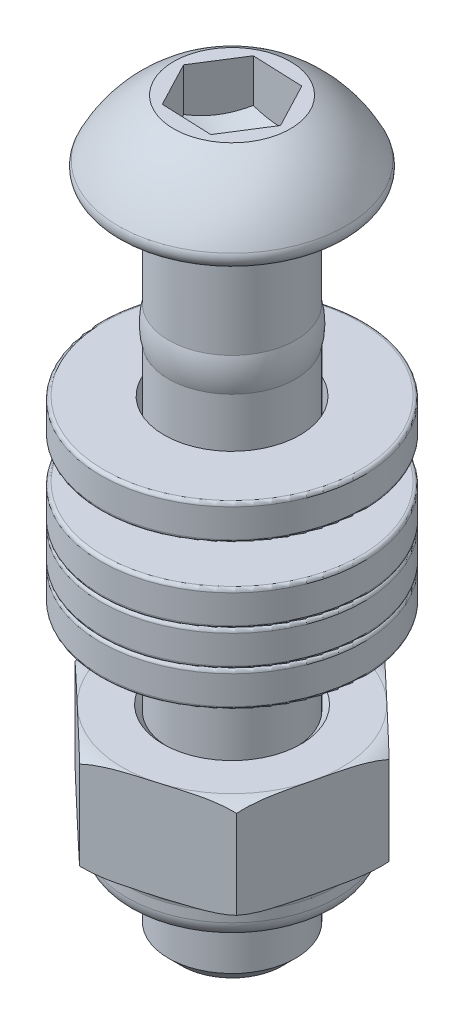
ISO-10303-21;
HEADER;
FILE_DESCRIPTION(('STEP AP214'),'2;1');
FILE_NAME('part.step','',(''),(''),'','','');
FILE_SCHEMA(('AUTOMOTIVE_DESIGN { 1 0 10303 214 1 1 1 1 }'));
ENDSEC;
DATA;
#1=APPLICATION_CONTEXT('core data for automotive mechanical design processes');
#2=APPLICATION_PROTOCOL_DEFINITION('international standard','automotive_design',2000,#1);
#3=PRODUCT_CONTEXT('',#1,'mechanical');
#4=PRODUCT('Part','Part','',(#3));
#5=PRODUCT_RELATED_PRODUCT_CATEGORY('part','',(#4));
#6=PRODUCT_DEFINITION_FORMATION('','',#4);
#7=PRODUCT_DEFINITION_CONTEXT('part definition',#1,'design');
#8=PRODUCT_DEFINITION('design','',#6,#7);
#9=PRODUCT_DEFINITION_SHAPE('','',#8);
#10=(LENGTH_UNIT() NAMED_UNIT(*) SI_UNIT(.MILLI.,.METRE.));
#11=(NAMED_UNIT(*) PLANE_ANGLE_UNIT() SI_UNIT($,.RADIAN.));
#12=(NAMED_UNIT(*) SI_UNIT($,.STERADIAN.) SOLID_ANGLE_UNIT());
#13=UNCERTAINTY_MEASURE_WITH_UNIT(LENGTH_MEASURE(1.E-05),#10,'distance_accuracy_value','');
#14=(GEOMETRIC_REPRESENTATION_CONTEXT(3) GLOBAL_UNCERTAINTY_ASSIGNED_CONTEXT((#13)) GLOBAL_UNIT_ASSIGNED_CONTEXT((#10,
#11,#12)) REPRESENTATION_CONTEXT('',''));
#15=CARTESIAN_POINT('',(0.,0.,0.));
#16=DIRECTION('',(0.,0.,1.));
#17=DIRECTION('',(1.,0.,0.));
#18=AXIS2_PLACEMENT_3D('',#15,#16,#17);
#19=CARTESIAN_POINT('',(0.,3.2,0.));
#20=DIRECTION('',(0.,1.,0.));
#21=DIRECTION('',(0.,0.,1.));
#22=AXIS2_PLACEMENT_3D('',#19,#20,#21);
#23=CYLINDRICAL_SURFACE('',#22,3.1);
#24=CARTESIAN_POINT('',(0.,-13.6,0.));
#25=DIRECTION('',(0.,1.,0.));
#26=DIRECTION('',(0.,0.,1.));
#27=AXIS2_PLACEMENT_3D('',#24,#25,#26);
#28=CIRCLE('',#27,3.1);
#29=CARTESIAN_POINT('',(0.,-13.6,3.1));
#30=VERTEX_POINT('',#29);
#31=EDGE_CURVE('E11',#30,#30,#28,.T.);
#32=ORIENTED_EDGE('',*,*,#31,.F.);
#33=EDGE_LOOP('',(#32));
#34=FACE_BOUND('',#33,.T.);
#35=CARTESIAN_POINT('',(0.,-12.,0.));
#36=DIRECTION('',(0.,1.,0.));
#37=DIRECTION('',(0.,0.,1.));
#38=AXIS2_PLACEMENT_3D('',#35,#36,#37);
#39=CIRCLE('',#38,3.1);
#40=CARTESIAN_POINT('',(0.,-12.,3.1));
#41=VERTEX_POINT('',#40);
#42=EDGE_CURVE('E66',#41,#41,#39,.T.);
#43=ORIENTED_EDGE('',*,*,#42,.T.);
#44=EDGE_LOOP('',(#43));
#45=FACE_BOUND('',#44,.T.);
#46=ADVANCED_FACE('F44',(#34,#45),#23,.F.);
#47=CARTESIAN_POINT('',(3.1,-13.6,0.));
#48=DIRECTION('',(0.,1.,0.));
#49=DIRECTION('',(0.,0.,1.));
#50=AXIS2_PLACEMENT_3D('',#47,#48,#49);
#51=PLANE('',#50);
#52=CARTESIAN_POINT('',(0.,-13.6,0.));
#53=DIRECTION('',(0.,1.,0.));
#54=DIRECTION('',(0.,0.,1.));
#55=AXIS2_PLACEMENT_3D('',#52,#53,#54);
#56=CIRCLE('',#55,5.85);
#57=CARTESIAN_POINT('',(0.,-13.6,5.85));
#58=VERTEX_POINT('',#57);
#59=EDGE_CURVE('E50',#58,#58,#56,.T.);
#60=ORIENTED_EDGE('',*,*,#59,.F.);
#61=EDGE_LOOP('',(#60));
#62=FACE_BOUND('',#61,.T.);
#63=ORIENTED_EDGE('',*,*,#31,.T.);
#64=EDGE_LOOP('',(#63));
#65=FACE_BOUND('',#64,.T.);
#66=ADVANCED_FACE('F91',(#62,#65),#51,.F.);
#67=CARTESIAN_POINT('',(0.,-13.45,0.));
#68=DIRECTION('',(0.,1.,0.));
#69=DIRECTION('',(0.,0.,1.));
#70=AXIS2_PLACEMENT_3D('',#67,#68,#69);
#71=TOROIDAL_SURFACE('',#70,5.85,0.15);
#72=CARTESIAN_POINT('',(0.,-13.45,0.));
#73=DIRECTION('',(0.,1.,0.));
#74=DIRECTION('',(0.,0.,1.));
#75=AXIS2_PLACEMENT_3D('',#72,#73,#74);
#76=CIRCLE('',#75,6.);
#77=CARTESIAN_POINT('',(0.,-13.45,6.));
#78=VERTEX_POINT('',#77);
#79=EDGE_CURVE('E54',#78,#78,#76,.T.);
#80=ORIENTED_EDGE('',*,*,#79,.F.);
#81=EDGE_LOOP('',(#80));
#82=FACE_BOUND('',#81,.T.);
#83=ORIENTED_EDGE('',*,*,#59,.T.);
#84=EDGE_LOOP('',(#83));
#85=FACE_BOUND('',#84,.T.);
#86=ADVANCED_FACE('F86',(#82,#85),#71,.T.);
#87=CARTESIAN_POINT('',(0.,3.2,0.));
#88=DIRECTION('',(0.,1.,0.));
#89=DIRECTION('',(0.,0.,1.));
#90=AXIS2_PLACEMENT_3D('',#87,#88,#89);
#91=CYLINDRICAL_SURFACE('',#90,6.);
#92=CARTESIAN_POINT('',(0.,-12.15,0.));
#93=DIRECTION('',(0.,1.,0.));
#94=DIRECTION('',(0.,0.,1.));
#95=AXIS2_PLACEMENT_3D('',#92,#93,#94);
#96=CIRCLE('',#95,6.);
#97=CARTESIAN_POINT('',(0.,-12.15,6.));
#98=VERTEX_POINT('',#97);
#99=EDGE_CURVE('E58',#98,#98,#96,.T.);
#100=ORIENTED_EDGE('',*,*,#99,.F.);
#101=EDGE_LOOP('',(#100));
#102=FACE_BOUND('',#101,.T.);
#103=ORIENTED_EDGE('',*,*,#79,.T.);
#104=EDGE_LOOP('',(#103));
#105=FACE_BOUND('',#104,.T.);
#106=ADVANCED_FACE('F80',(#102,#105),#91,.T.);
#107=CARTESIAN_POINT('',(0.,-12.15,0.));
#108=DIRECTION('',(0.,1.,0.));
#109=DIRECTION('',(0.,0.,1.));
#110=AXIS2_PLACEMENT_3D('',#107,#108,#109);
#111=TOROIDAL_SURFACE('',#110,5.85,0.15);
#112=CARTESIAN_POINT('',(0.,-12.,0.));
#113=DIRECTION('',(0.,1.,0.));
#114=DIRECTION('',(0.,0.,1.));
#115=AXIS2_PLACEMENT_3D('',#112,#113,#114);
#116=CIRCLE('',#115,5.85);
#117=CARTESIAN_POINT('',(0.,-12.,5.85));
#118=VERTEX_POINT('',#117);
#119=EDGE_CURVE('E63',#118,#118,#116,.T.);
#120=ORIENTED_EDGE('',*,*,#119,.F.);
#121=EDGE_LOOP('',(#120));
#122=FACE_BOUND('',#121,.T.);
#123=ORIENTED_EDGE('',*,*,#99,.T.);
#124=EDGE_LOOP('',(#123));
#125=FACE_BOUND('',#124,.T.);
#126=ADVANCED_FACE('F74',(#122,#125),#111,.T.);
#127=CARTESIAN_POINT('',(3.1,-12.,0.));
#128=DIRECTION('',(0.,-1.,0.));
#129=DIRECTION('',(0.,0.,-1.));
#130=AXIS2_PLACEMENT_3D('',#127,#128,#129);
#131=PLANE('',#130);
#132=ORIENTED_EDGE('',*,*,#42,.F.);
#133=EDGE_LOOP('',(#132));
#134=FACE_BOUND('',#133,.T.);
#135=ORIENTED_EDGE('',*,*,#119,.T.);
#136=EDGE_LOOP('',(#135));
#137=FACE_BOUND('',#136,.T.);
#138=ADVANCED_FACE('F71',(#134,#137),#131,.F.);
#139=CLOSED_SHELL('',(#46,#66,#86,#106,#126,#138));
#140=MANIFOLD_SOLID_BREP('B2',#139);
#141=CARTESIAN_POINT('',(0.,1.6,0.));
#142=DIRECTION('',(0.,1.,0.));
#143=DIRECTION('',(0.,0.,1.));
#144=AXIS2_PLACEMENT_3D('',#141,#142,#143);
#145=CYLINDRICAL_SURFACE('',#144,3.1);
#146=CARTESIAN_POINT('',(0.,-15.2,0.));
#147=DIRECTION('',(0.,1.,0.));
#148=DIRECTION('',(0.,0.,1.));
#149=AXIS2_PLACEMENT_3D('',#146,#147,#148);
#150=CIRCLE('',#149,3.1);
#151=CARTESIAN_POINT('',(0.,-15.2,3.1));
#152=VERTEX_POINT('',#151);
#153=EDGE_CURVE('E43',#152,#152,#150,.T.);
#154=ORIENTED_EDGE('',*,*,#153,.F.);
#155=EDGE_LOOP('',(#154));
#156=FACE_BOUND('',#155,.T.);
#157=CARTESIAN_POINT('',(0.,-13.6,0.));
#158=DIRECTION('',(0.,1.,0.));
#159=DIRECTION('',(0.,0.,1.));
#160=AXIS2_PLACEMENT_3D('',#157,#158,#159);
#161=CIRCLE('',#160,3.1);
#162=CARTESIAN_POINT('',(0.,-13.6,3.1));
#163=VERTEX_POINT('',#162);
#164=EDGE_CURVE('E166',#163,#163,#161,.T.);
#165=ORIENTED_EDGE('',*,*,#164,.T.);
#166=EDGE_LOOP('',(#165));
#167=FACE_BOUND('',#166,.T.);
#168=ADVANCED_FACE('F144',(#156,#167),#145,.F.);
#169=CARTESIAN_POINT('',(3.1,-15.2,0.));
#170=DIRECTION('',(0.,1.,0.));
#171=DIRECTION('',(0.,0.,1.));
#172=AXIS2_PLACEMENT_3D('',#169,#170,#171);
#173=PLANE('',#172);
#174=CARTESIAN_POINT('',(0.,-15.2,0.));
#175=DIRECTION('',(0.,1.,0.));
#176=DIRECTION('',(0.,0.,1.));
#177=AXIS2_PLACEMENT_3D('',#174,#175,#176);
#178=CIRCLE('',#177,5.85);
#179=CARTESIAN_POINT('',(0.,-15.2,5.85));
#180=VERTEX_POINT('',#179);
#181=EDGE_CURVE('E150',#180,#180,#178,.T.);
#182=ORIENTED_EDGE('',*,*,#181,.F.);
#183=EDGE_LOOP('',(#182));
#184=FACE_BOUND('',#183,.T.);
#185=ORIENTED_EDGE('',*,*,#153,.T.);
#186=EDGE_LOOP('',(#185));
#187=FACE_BOUND('',#186,.T.);
#188=ADVANCED_FACE('F191',(#184,#187),#173,.F.);
#189=CARTESIAN_POINT('',(0.,-15.05,0.));
#190=DIRECTION('',(0.,1.,0.));
#191=DIRECTION('',(0.,0.,1.));
#192=AXIS2_PLACEMENT_3D('',#189,#190,#191);
#193=TOROIDAL_SURFACE('',#192,5.85,0.15);
#194=CARTESIAN_POINT('',(0.,-15.05,0.));
#195=DIRECTION('',(0.,1.,0.));
#196=DIRECTION('',(0.,0.,1.));
#197=AXIS2_PLACEMENT_3D('',#194,#195,#196);
#198=CIRCLE('',#197,6.);
#199=CARTESIAN_POINT('',(0.,-15.05,6.));
#200=VERTEX_POINT('',#199);
#201=EDGE_CURVE('E154',#200,#200,#198,.T.);
#202=ORIENTED_EDGE('',*,*,#201,.F.);
#203=EDGE_LOOP('',(#202));
#204=FACE_BOUND('',#203,.T.);
#205=ORIENTED_EDGE('',*,*,#181,.T.);
#206=EDGE_LOOP('',(#205));
#207=FACE_BOUND('',#206,.T.);
#208=ADVANCED_FACE('F186',(#204,#207),#193,.T.);
#209=CARTESIAN_POINT('',(0.,1.6,0.));
#210=DIRECTION('',(0.,1.,0.));
#211=DIRECTION('',(0.,0.,1.));
#212=AXIS2_PLACEMENT_3D('',#209,#210,#211);
#213=CYLINDRICAL_SURFACE('',#212,6.);
#214=CARTESIAN_POINT('',(0.,-13.75,0.));
#215=DIRECTION('',(0.,1.,0.));
#216=DIRECTION('',(0.,0.,1.));
#217=AXIS2_PLACEMENT_3D('',#214,#215,#216);
#218=CIRCLE('',#217,6.);
#219=CARTESIAN_POINT('',(0.,-13.75,6.));
#220=VERTEX_POINT('',#219);
#221=EDGE_CURVE('E158',#220,#220,#218,.T.);
#222=ORIENTED_EDGE('',*,*,#221,.F.);
#223=EDGE_LOOP('',(#222));
#224=FACE_BOUND('',#223,.T.);
#225=ORIENTED_EDGE('',*,*,#201,.T.);
#226=EDGE_LOOP('',(#225));
#227=FACE_BOUND('',#226,.T.);
#228=ADVANCED_FACE('F180',(#224,#227),#213,.T.);
#229=CARTESIAN_POINT('',(0.,-13.75,0.));
#230=DIRECTION('',(0.,1.,0.));
#231=DIRECTION('',(0.,0.,1.));
#232=AXIS2_PLACEMENT_3D('',#229,#230,#231);
#233=TOROIDAL_SURFACE('',#232,5.85,0.15);
#234=CARTESIAN_POINT('',(0.,-13.6,0.));
#235=DIRECTION('',(0.,1.,0.));
#236=DIRECTION('',(0.,0.,1.));
#237=AXIS2_PLACEMENT_3D('',#234,#235,#236);
#238=CIRCLE('',#237,5.85);
#239=CARTESIAN_POINT('',(0.,-13.6,5.85));
#240=VERTEX_POINT('',#239);
#241=EDGE_CURVE('E163',#240,#240,#238,.T.);
#242=ORIENTED_EDGE('',*,*,#241,.F.);
#243=EDGE_LOOP('',(#242));
#244=FACE_BOUND('',#243,.T.);
#245=ORIENTED_EDGE('',*,*,#221,.T.);
#246=EDGE_LOOP('',(#245));
#247=FACE_BOUND('',#246,.T.);
#248=ADVANCED_FACE('F174',(#244,#247),#233,.T.);
#249=CARTESIAN_POINT('',(3.1,-13.6,0.));
#250=DIRECTION('',(0.,-1.,0.));
#251=DIRECTION('',(0.,0.,-1.));
#252=AXIS2_PLACEMENT_3D('',#249,#250,#251);
#253=PLANE('',#252);
#254=ORIENTED_EDGE('',*,*,#164,.F.);
#255=EDGE_LOOP('',(#254));
#256=FACE_BOUND('',#255,.T.);
#257=ORIENTED_EDGE('',*,*,#241,.T.);
#258=EDGE_LOOP('',(#257));
#259=FACE_BOUND('',#258,.T.);
#260=ADVANCED_FACE('F171',(#256,#259),#253,.F.);
#261=CLOSED_SHELL('',(#168,#188,#208,#228,#248,#260));
#262=MANIFOLD_SOLID_BREP('B6',#261);
#263=CARTESIAN_POINT('',(0.,6.6,0.));
#264=DIRECTION('',(0.,1.,0.));
#265=DIRECTION('',(0.,0.,1.));
#266=AXIS2_PLACEMENT_3D('',#263,#264,#265);
#267=CYLINDRICAL_SURFACE('',#266,3.1);
#268=CARTESIAN_POINT('',(0.,-10.2,0.));
#269=DIRECTION('',(0.,1.,0.));
#270=DIRECTION('',(0.,0.,1.));
#271=AXIS2_PLACEMENT_3D('',#268,#269,#270);
#272=CIRCLE('',#271,3.1);
#273=CARTESIAN_POINT('',(0.,-10.2,3.1));
#274=VERTEX_POINT('',#273);
#275=EDGE_CURVE('E143',#274,#274,#272,.T.);
#276=ORIENTED_EDGE('',*,*,#275,.F.);
#277=EDGE_LOOP('',(#276));
#278=FACE_BOUND('',#277,.T.);
#279=CARTESIAN_POINT('',(0.,-8.6,0.));
#280=DIRECTION('',(0.,1.,0.));
#281=DIRECTION('',(0.,0.,1.));
#282=AXIS2_PLACEMENT_3D('',#279,#280,#281);
#283=CIRCLE('',#282,3.1);
#284=CARTESIAN_POINT('',(0.,-8.6,3.1));
#285=VERTEX_POINT('',#284);
#286=EDGE_CURVE('E268',#285,#285,#283,.T.);
#287=ORIENTED_EDGE('',*,*,#286,.T.);
#288=EDGE_LOOP('',(#287));
#289=FACE_BOUND('',#288,.T.);
#290=ADVANCED_FACE('F246',(#278,#289),#267,.F.);
#291=CARTESIAN_POINT('',(3.1,-10.2,0.));
#292=DIRECTION('',(0.,1.,0.));
#293=DIRECTION('',(0.,0.,1.));
#294=AXIS2_PLACEMENT_3D('',#291,#292,#293);
#295=PLANE('',#294);
#296=CARTESIAN_POINT('',(0.,-10.2,0.));
#297=DIRECTION('',(0.,1.,0.));
#298=DIRECTION('',(0.,0.,1.));
#299=AXIS2_PLACEMENT_3D('',#296,#297,#298);
#300=CIRCLE('',#299,5.85);
#301=CARTESIAN_POINT('',(0.,-10.2,5.85));
#302=VERTEX_POINT('',#301);
#303=EDGE_CURVE('E252',#302,#302,#300,.T.);
#304=ORIENTED_EDGE('',*,*,#303,.F.);
#305=EDGE_LOOP('',(#304));
#306=FACE_BOUND('',#305,.T.);
#307=ORIENTED_EDGE('',*,*,#275,.T.);
#308=EDGE_LOOP('',(#307));
#309=FACE_BOUND('',#308,.T.);
#310=ADVANCED_FACE('F293',(#306,#309),#295,.F.);
#311=CARTESIAN_POINT('',(0.,-10.05,0.));
#312=DIRECTION('',(0.,1.,0.));
#313=DIRECTION('',(0.,0.,1.));
#314=AXIS2_PLACEMENT_3D('',#311,#312,#313);
#315=TOROIDAL_SURFACE('',#314,5.85,0.15);
#316=CARTESIAN_POINT('',(0.,-10.05,0.));
#317=DIRECTION('',(0.,1.,0.));
#318=DIRECTION('',(0.,0.,1.));
#319=AXIS2_PLACEMENT_3D('',#316,#317,#318);
#320=CIRCLE('',#319,6.);
#321=CARTESIAN_POINT('',(0.,-10.05,6.));
#322=VERTEX_POINT('',#321);
#323=EDGE_CURVE('E256',#322,#322,#320,.T.);
#324=ORIENTED_EDGE('',*,*,#323,.F.);
#325=EDGE_LOOP('',(#324));
#326=FACE_BOUND('',#325,.T.);
#327=ORIENTED_EDGE('',*,*,#303,.T.);
#328=EDGE_LOOP('',(#327));
#329=FACE_BOUND('',#328,.T.);
#330=ADVANCED_FACE('F288',(#326,#329),#315,.T.);
#331=CARTESIAN_POINT('',(0.,6.6,0.));
#332=DIRECTION('',(0.,1.,0.));
#333=DIRECTION('',(0.,0.,1.));
#334=AXIS2_PLACEMENT_3D('',#331,#332,#333);
#335=CYLINDRICAL_SURFACE('',#334,6.);
#336=CARTESIAN_POINT('',(0.,-8.75,0.));
#337=DIRECTION('',(0.,1.,0.));
#338=DIRECTION('',(0.,0.,1.));
#339=AXIS2_PLACEMENT_3D('',#336,#337,#338);
#340=CIRCLE('',#339,6.);
#341=CARTESIAN_POINT('',(0.,-8.75,6.));
#342=VERTEX_POINT('',#341);
#343=EDGE_CURVE('E260',#342,#342,#340,.T.);
#344=ORIENTED_EDGE('',*,*,#343,.F.);
#345=EDGE_LOOP('',(#344));
#346=FACE_BOUND('',#345,.T.);
#347=ORIENTED_EDGE('',*,*,#323,.T.);
#348=EDGE_LOOP('',(#347));
#349=FACE_BOUND('',#348,.T.);
#350=ADVANCED_FACE('F282',(#346,#349),#335,.T.);
#351=CARTESIAN_POINT('',(0.,-8.75,0.));
#352=DIRECTION('',(0.,1.,0.));
#353=DIRECTION('',(0.,0.,1.));
#354=AXIS2_PLACEMENT_3D('',#351,#352,#353);
#355=TOROIDAL_SURFACE('',#354,5.85,0.15);
#356=CARTESIAN_POINT('',(0.,-8.6,0.));
#357=DIRECTION('',(0.,1.,0.));
#358=DIRECTION('',(0.,0.,1.));
#359=AXIS2_PLACEMENT_3D('',#356,#357,#358);
#360=CIRCLE('',#359,5.85);
#361=CARTESIAN_POINT('',(0.,-8.6,5.85));
#362=VERTEX_POINT('',#361);
#363=EDGE_CURVE('E265',#362,#362,#360,.T.);
#364=ORIENTED_EDGE('',*,*,#363,.F.);
#365=EDGE_LOOP('',(#364));
#366=FACE_BOUND('',#365,.T.);
#367=ORIENTED_EDGE('',*,*,#343,.T.);
#368=EDGE_LOOP('',(#367));
#369=FACE_BOUND('',#368,.T.);
#370=ADVANCED_FACE('F276',(#366,#369),#355,.T.);
#371=CARTESIAN_POINT('',(3.1,-8.6,0.));
#372=DIRECTION('',(0.,-1.,0.));
#373=DIRECTION('',(0.,0.,-1.));
#374=AXIS2_PLACEMENT_3D('',#371,#372,#373);
#375=PLANE('',#374);
#376=ORIENTED_EDGE('',*,*,#286,.F.);
#377=EDGE_LOOP('',(#376));
#378=FACE_BOUND('',#377,.T.);
#379=ORIENTED_EDGE('',*,*,#363,.T.);
#380=EDGE_LOOP('',(#379));
#381=FACE_BOUND('',#380,.T.);
#382=ADVANCED_FACE('F273',(#378,#381),#375,.F.);
#383=CLOSED_SHELL('',(#290,#310,#330,#350,#370,#382));
#384=MANIFOLD_SOLID_BREP('B38_NOT_SHOWN',#383);
#385=CARTESIAN_POINT('',(0.,-25.5969881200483,0.));
#386=DIRECTION('',(0.,1.,0.));
#387=DIRECTION('',(0.,0.,1.));
#388=AXIS2_PLACEMENT_3D('',#385,#386,#387);
#389=TOROIDAL_SURFACE('',#388,5.1,0.299999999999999);
#390=CARTESIAN_POINT('',(0.,-25.5969881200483,0.));
#391=DIRECTION('',(0.,1.,0.));
#392=DIRECTION('',(0.,0.,1.));
#393=AXIS2_PLACEMENT_3D('',#390,#391,#392);
#394=CIRCLE('',#393,4.8);
#395=CARTESIAN_POINT('',(0.,-25.5969881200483,4.8));
#396=VERTEX_POINT('',#395);
#397=EDGE_CURVE('E615',#396,#396,#394,.T.);
#398=ORIENTED_EDGE('',*,*,#397,.T.);
#399=EDGE_LOOP('',(#398));
#400=FACE_BOUND('',#399,.T.);
#401=CARTESIAN_POINT('',(-4.64488190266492,-25.2973315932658,-2.07096417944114));
#402=CARTESIAN_POINT('',(-4.65655570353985,-25.2977780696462,-2.0223391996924));
#403=CARTESIAN_POINT('',(-4.6682279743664,-25.2985916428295,-1.97372059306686));
#404=CARTESIAN_POINT('',(-4.69157026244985,-25.3006388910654,-1.87649276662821));
#405=CARTESIAN_POINT('',(-4.70324027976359,-25.301872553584,-1.82788354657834));
#406=CARTESIAN_POINT('',(-4.72657917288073,-25.3044459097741,-1.73066986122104));
#407=CARTESIAN_POINT('',(-4.73824804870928,-25.3057855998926,-1.68206539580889));
#408=CARTESIAN_POINT('',(-4.76158667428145,-25.3083237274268,-1.58485282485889));
#409=CARTESIAN_POINT('',(-4.77325642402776,-25.3095221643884,-1.53624471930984));
#410=CARTESIAN_POINT('',(-4.80879504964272,-25.312626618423,-1.38821538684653));
#411=CARTESIAN_POINT('',(-4.83266726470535,-25.3139631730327,-1.28878025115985));
#412=CARTESIAN_POINT('',(-4.88041257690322,-25.3142910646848,-1.08990630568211));
#413=CARTESIAN_POINT('',(-4.90428567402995,-25.3132824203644,-0.990467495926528));
#414=CARTESIAN_POINT('',(-4.94071015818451,-25.3104456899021,-0.838748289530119));
#415=CARTESIAN_POINT('',(-4.95326474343,-25.3092325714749,-0.786454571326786));
#416=CARTESIAN_POINT('',(-4.97837264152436,-25.3065834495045,-0.681872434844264));
#417=CARTESIAN_POINT('',(-4.99092595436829,-25.305147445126,-0.629584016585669));
#418=CARTESIAN_POINT('',(-5.01603429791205,-25.3023486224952,-0.525000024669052));
#419=CARTESIAN_POINT('',(-5.02858932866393,-25.3009858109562,-0.47270445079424));
#420=CARTESIAN_POINT('',(-5.05370175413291,-25.2987185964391,-0.368103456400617));
#421=CARTESIAN_POINT('',(-5.06625914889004,-25.2978142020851,-0.315798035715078));
#422=CARTESIAN_POINT('',(-5.07881838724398,-25.2973315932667,-0.263484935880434));
#423=B_SPLINE_CURVE_WITH_KNOTS('',3,(#401,#402,#403,#404,#405,#406,#407,#408,#409,#410,#411,
#412,#413,#414,#415,#416,#417,#418,#419,#420,#421,#422),.UNSPECIFIED.,.F.,.F.,(4,2,2,2,2,2,2,2,
2,2,4),(0.,0.150020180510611,0.30003588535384,0.450046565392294,0.600057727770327,
0.906843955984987,1.21362774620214,1.3750074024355,1.53638766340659,1.69778270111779,
1.85918077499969),.UNSPECIFIED.);
#424=CARTESIAN_POINT('',(-4.6496565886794,-25.2975315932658,-2.05107614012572));
#425=VERTEX_POINT('',#424);
#426=CARTESIAN_POINT('',(-5.07404370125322,-25.2975315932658,-0.283372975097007));
#427=VERTEX_POINT('',#426);
#428=EDGE_CURVE('E589',#425,#427,#423,.T.);
#429=ORIENTED_EDGE('',*,*,#428,.F.);
#430=CARTESIAN_POINT('',(0.,-25.2975315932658,0.));
#431=DIRECTION('',(0.,1.,0.));
#432=DIRECTION('',(0.,0.,1.));
#433=AXIS2_PLACEMENT_3D('',#430,#431,#432);
#434=CIRCLE('',#433,5.08195038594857);
#435=CARTESIAN_POINT('',(-2.29161365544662,-25.2975315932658,-4.53593723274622));
#436=VERTEX_POINT('',#435);
#437=EDGE_CURVE('E739',#436,#425,#434,.T.);
#438=ORIENTED_EDGE('',*,*,#437,.F.);
#439=CARTESIAN_POINT('',(-0.528933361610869,-25.2973315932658,-5.05806781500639));
#440=CARTESIAN_POINT('',(-0.576880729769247,-25.2977780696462,-5.04386513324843));
#441=CARTESIAN_POINT('',(-0.624821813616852,-25.2985916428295,-5.0296643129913));
#442=CARTESIAN_POINT('',(-0.720694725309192,-25.3006388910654,-5.0012654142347));
#443=CARTESIAN_POINT('',(-0.768626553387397,-25.3018725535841,-4.98706733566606));
#444=CARTESIAN_POINT('',(-0.864485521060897,-25.3044459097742,-4.95867256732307));
#445=CARTESIAN_POINT('',(-0.912412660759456,-25.3057855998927,-4.94447587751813));
#446=CARTESIAN_POINT('',(-1.00827052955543,-25.3083237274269,-4.91608143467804));
#447=CARTESIAN_POINT('',(-1.0562012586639,-25.3095221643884,-4.90188368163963));
#448=CARTESIAN_POINT('',(-1.20216773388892,-25.312626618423,-4.85864636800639));
#449=CARTESIAN_POINT('',(-1.30021719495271,-25.3139631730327,-4.82960274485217));
#450=CARTESIAN_POINT('',(-1.49631973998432,-25.3142910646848,-4.77151442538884));
#451=CARTESIAN_POINT('',(-1.59437282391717,-25.3132824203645,-4.74246972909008));
#452=CARTESIAN_POINT('',(-1.74397775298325,-25.310445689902,-4.69815465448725));
#453=CARTESIAN_POINT('',(-1.79554273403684,-25.3092325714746,-4.68288038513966));
#454=CARTESIAN_POINT('',(-1.89866747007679,-25.3065834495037,-4.65233339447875));
#455=CARTESIAN_POINT('',(-1.95022722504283,-25.305147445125,-4.63706067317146));
#456=CARTESIAN_POINT('',(-2.05335379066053,-25.3023486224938,-4.60651314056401));
#457=CARTESIAN_POINT('',(-2.10492060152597,-25.3009858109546,-4.59123832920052));
#458=CARTESIAN_POINT('',(-2.20806393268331,-25.2987185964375,-4.56068583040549));
#459=CARTESIAN_POINT('',(-2.25964045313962,-25.2978142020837,-4.54540814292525));
#460=CARTESIAN_POINT('',(-2.31122454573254,-25.2973315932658,-4.53012821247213));
#461=B_SPLINE_CURVE_WITH_KNOTS('',3,(#439,#440,#441,#442,#443,#444,#445,#446,#447,#448,#449,
#450,#451,#452,#453,#454,#455,#456,#457,#458,#459,#460),.UNSPECIFIED.,.F.,.F.,(4,2,2,2,2,2,2,2,
2,2,4),(0.,0.150020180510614,0.300035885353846,0.450046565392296,0.600057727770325,
0.906843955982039,1.21362774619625,1.37500740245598,1.53638766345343,1.697782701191,
1.85918077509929),.UNSPECIFIED.);
#462=CARTESIAN_POINT('',(-0.548544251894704,-25.2975315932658,-5.05225879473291));
#463=VERTEX_POINT('',#462);
#464=EDGE_CURVE('E552',#463,#436,#461,.T.);
#465=ORIENTED_EDGE('',*,*,#464,.F.);
#466=CARTESIAN_POINT('',(2.78243004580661,-25.2975315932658,-4.25256425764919));
#467=VERTEX_POINT('',#466);
#468=EDGE_CURVE('E742',#467,#463,#434,.T.);
#469=ORIENTED_EDGE('',*,*,#468,.F.);
#470=CARTESIAN_POINT('',(4.11594854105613,-25.2973315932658,-2.9871036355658));
#471=CARTESIAN_POINT('',(4.07967497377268,-25.2977780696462,-3.02152593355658));
#472=CARTESIAN_POINT('',(4.04340616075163,-25.2985916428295,-3.05594371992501));
#473=CARTESIAN_POINT('',(3.97087553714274,-25.3006388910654,-3.12477264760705));
#474=CARTESIAN_POINT('',(3.93461372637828,-25.301872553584,-3.15918378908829));
#475=CARTESIAN_POINT('',(3.86209365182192,-25.3044459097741,-3.22800270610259));
#476=CARTESIAN_POINT('',(3.82583538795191,-25.3057855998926,-3.2624104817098));
#477=CARTESIAN_POINT('',(3.7533161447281,-25.3083237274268,-3.33122860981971));
#478=CARTESIAN_POINT('',(3.71705516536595,-25.3095221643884,-3.36563896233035));
#479=CARTESIAN_POINT('',(3.60662731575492,-25.312626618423,-3.47043098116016));
#480=CARTESIAN_POINT('',(3.5324500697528,-25.3139631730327,-3.54082249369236));
#481=CARTESIAN_POINT('',(3.38409283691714,-25.3142910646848,-3.68160811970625));
#482=CARTESIAN_POINT('',(3.30991285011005,-25.3132824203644,-3.75200223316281));
#483=CARTESIAN_POINT('',(3.19673240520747,-25.3104456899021,-3.85940636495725));
#484=CARTESIAN_POINT('',(3.15772200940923,-25.309232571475,-3.89642581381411));
#485=CARTESIAN_POINT('',(3.0797051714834,-25.3065834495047,-3.97046095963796));
#486=CARTESIAN_POINT('',(3.04069872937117,-25.3051474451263,-4.00747665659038));
#487=CARTESIAN_POINT('',(2.96268050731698,-25.3023486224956,-4.08151311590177));
#488=CARTESIAN_POINT('',(2.9236687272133,-25.3009858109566,-4.11853387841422));
#489=CARTESIAN_POINT('',(2.8456378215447,-25.2987185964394,-4.19258237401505));
#490=CARTESIAN_POINT('',(2.80661869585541,-25.2978142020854,-4.22961010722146));
#491=CARTESIAN_POINT('',(2.76759384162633,-25.2973315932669,-4.2666432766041));
#492=B_SPLINE_CURVE_WITH_KNOTS('',3,(#470,#471,#472,#473,#474,#475,#476,#477,#478,#479,#480,
#481,#482,#483,#484,#485,#486,#487,#488,#489,#490,#491),.UNSPECIFIED.,.F.,.F.,(4,2,2,2,2,2,2,2,
2,2,4),(0.,0.150020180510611,0.300035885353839,0.450046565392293,0.600057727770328,
0.906843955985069,1.2136277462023,1.37500740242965,1.53638766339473,1.69778270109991,
1.85918077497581),.UNSPECIFIED.);
#493=CARTESIAN_POINT('',(4.1011123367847,-25.2975315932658,-3.00118265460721));
#494=VERTEX_POINT('',#493);
#495=EDGE_CURVE('E545',#494,#467,#492,.T.);
#496=ORIENTED_EDGE('',*,*,#495,.F.);
#497=CARTESIAN_POINT('',(5.07404370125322,-25.2975315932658,0.283372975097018));
#498=VERTEX_POINT('',#497);
#499=EDGE_CURVE('E355',#498,#494,#434,.T.);
#500=ORIENTED_EDGE('',*,*,#499,.F.);
#501=CARTESIAN_POINT('',(4.64488190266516,-25.2973315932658,2.07096417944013));
#502=CARTESIAN_POINT('',(4.65655570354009,-25.2977780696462,2.02233919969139));
#503=CARTESIAN_POINT('',(4.66822797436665,-25.2985916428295,1.97372059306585));
#504=CARTESIAN_POINT('',(4.6915702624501,-25.3006388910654,1.8764927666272));
#505=CARTESIAN_POINT('',(4.70324027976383,-25.3018725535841,1.82788354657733));
#506=CARTESIAN_POINT('',(4.72657917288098,-25.3044459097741,1.73066986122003));
#507=CARTESIAN_POINT('',(4.73824804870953,-25.3057855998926,1.68206539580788));
#508=CARTESIAN_POINT('',(4.7615866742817,-25.3083237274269,1.58485282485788));
#509=CARTESIAN_POINT('',(4.77325642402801,-25.3095221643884,1.53624471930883));
#510=CARTESIAN_POINT('',(4.80879504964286,-25.312626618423,1.38821538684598));
#511=CARTESIAN_POINT('',(4.83266726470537,-25.3139631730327,1.28878025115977));
#512=CARTESIAN_POINT('',(4.88041257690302,-25.3142910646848,1.08990630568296));
#513=CARTESIAN_POINT('',(4.90428567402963,-25.3132824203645,0.990467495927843));
#514=CARTESIAN_POINT('',(4.94071015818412,-25.3104456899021,0.838748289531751));
#515=CARTESIAN_POINT('',(4.95326474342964,-25.3092325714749,0.786454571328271));
#516=CARTESIAN_POINT('',(4.97837264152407,-25.3065834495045,0.681872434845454));
#517=CARTESIAN_POINT('',(4.99092595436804,-25.3051474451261,0.629584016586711));
#518=CARTESIAN_POINT('',(5.01603429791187,-25.3023486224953,0.525000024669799));
#519=CARTESIAN_POINT('',(5.02858932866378,-25.3009858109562,0.472704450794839));
#520=CARTESIAN_POINT('',(5.05370175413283,-25.2987185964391,0.368103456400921));
#521=CARTESIAN_POINT('',(5.06625914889,-25.2978142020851,0.315798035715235));
#522=CARTESIAN_POINT('',(5.07881838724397,-25.2973315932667,0.263484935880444));
#523=B_SPLINE_CURVE_WITH_KNOTS('',3,(#501,#502,#503,#504,#505,#506,#507,#508,#509,#510,#511,
#512,#513,#514,#515,#516,#517,#518,#519,#520,#521,#522),.UNSPECIFIED.,.F.,.F.,(4,2,2,2,2,2,2,2,
2,2,4),(0.,0.150020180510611,0.30003588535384,0.450046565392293,0.600057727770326,
0.90684395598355,1.21362774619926,1.37500740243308,1.53638766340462,1.69778270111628,
1.85918077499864),.UNSPECIFIED.);
#524=CARTESIAN_POINT('',(4.64965658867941,-25.2975315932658,2.05107614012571));
#525=VERTEX_POINT('',#524);
#526=EDGE_CURVE('E520',#525,#498,#523,.T.);
#527=ORIENTED_EDGE('',*,*,#526,.F.);
#528=CARTESIAN_POINT('',(2.29161365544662,-25.2975315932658,4.53593723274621));
#529=VERTEX_POINT('',#528);
#530=EDGE_CURVE('E244',#529,#525,#434,.T.);
#531=ORIENTED_EDGE('',*,*,#530,.F.);
#532=CARTESIAN_POINT('',(0.528933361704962,-25.2973315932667,5.05806781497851));
#533=CARTESIAN_POINT('',(0.576880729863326,-25.2977780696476,5.04386513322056));
#534=CARTESIAN_POINT('',(0.624821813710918,-25.2985916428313,5.02966431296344));
#535=CARTESIAN_POINT('',(0.720694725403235,-25.3006388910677,5.00126541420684));
#536=CARTESIAN_POINT('',(0.768626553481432,-25.3018725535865,4.98706733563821));
#537=CARTESIAN_POINT('',(0.864485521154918,-25.3044459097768,4.95867256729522));
#538=CARTESIAN_POINT('',(0.912412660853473,-25.3057855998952,4.94447587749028));
#539=CARTESIAN_POINT('',(1.00827052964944,-25.3083237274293,4.9160814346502));
#540=CARTESIAN_POINT('',(1.05620125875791,-25.3095221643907,4.90188368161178));
#541=CARTESIAN_POINT('',(1.20216773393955,-25.3126266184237,4.85864636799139));
#542=CARTESIAN_POINT('',(1.30021719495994,-25.3139631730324,4.82960274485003));
#543=CARTESIAN_POINT('',(1.49631973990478,-25.314291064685,4.7715144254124));
#544=CARTESIAN_POINT('',(1.59437282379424,-25.3132824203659,4.74246972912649));
#545=CARTESIAN_POINT('',(1.74397775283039,-25.3104456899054,4.69815465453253));
#546=CARTESIAN_POINT('',(1.79554273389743,-25.309232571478,4.68288038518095));
#547=CARTESIAN_POINT('',(1.89866746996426,-25.3065834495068,4.65233339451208));
#548=CARTESIAN_POINT('',(1.95022722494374,-25.3051474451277,4.63706067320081));
#549=CARTESIAN_POINT('',(2.05335379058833,-25.3023486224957,4.60651314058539));
#550=CARTESIAN_POINT('',(2.10492060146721,-25.300985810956,4.59123832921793));
#551=CARTESIAN_POINT('',(2.20806393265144,-25.2987185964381,4.56068583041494));
#552=CARTESIAN_POINT('',(2.25964045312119,-25.2978142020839,4.54540814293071));
#553=CARTESIAN_POINT('',(2.31122454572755,-25.2973315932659,4.5301282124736));
#554=B_SPLINE_CURVE_WITH_KNOTS('',3,(#532,#533,#534,#535,#536,#537,#538,#539,#540,#541,#542,
#543,#544,#545,#546,#547,#548,#549,#550,#551,#552,#553),.UNSPECIFIED.,.F.,.F.,(4,2,2,2,2,2,2,2,
2,2,4),(0.,0.15002018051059,0.300035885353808,0.450046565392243,0.600057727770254,
0.906843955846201,1.21362774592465,1.37500740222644,1.53638766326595,1.6977827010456,
1.85918077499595),.UNSPECIFIED.);
#555=CARTESIAN_POINT('',(0.548544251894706,-25.2975315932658,5.05225879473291));
#556=VERTEX_POINT('',#555);
#557=EDGE_CURVE('E473',#556,#529,#554,.T.);
#558=ORIENTED_EDGE('',*,*,#557,.F.);
#559=CARTESIAN_POINT('',(-2.7824300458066,-25.2975315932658,4.2525642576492));
#560=VERTEX_POINT('',#559);
#561=EDGE_CURVE('E350',#560,#556,#434,.T.);
#562=ORIENTED_EDGE('',*,*,#561,.F.);
#563=CARTESIAN_POINT('',(-4.11594854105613,-25.2973315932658,2.9871036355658));
#564=CARTESIAN_POINT('',(-4.07967497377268,-25.2977780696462,3.02152593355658));
#565=CARTESIAN_POINT('',(-4.04340616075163,-25.2985916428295,3.05594371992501));
#566=CARTESIAN_POINT('',(-3.97087553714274,-25.3006388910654,3.12477264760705));
#567=CARTESIAN_POINT('',(-3.93461372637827,-25.301872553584,3.15918378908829));
#568=CARTESIAN_POINT('',(-3.86209365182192,-25.3044459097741,3.22800270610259));
#569=CARTESIAN_POINT('',(-3.82583538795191,-25.3057855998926,3.2624104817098));
#570=CARTESIAN_POINT('',(-3.7533161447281,-25.3083237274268,3.33122860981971));
#571=CARTESIAN_POINT('',(-3.71705516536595,-25.3095221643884,3.36563896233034));
#572=CARTESIAN_POINT('',(-3.60662731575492,-25.312626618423,3.47043098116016));
#573=CARTESIAN_POINT('',(-3.5324500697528,-25.3139631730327,3.54082249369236));
#574=CARTESIAN_POINT('',(-3.38409283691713,-25.3142910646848,3.68160811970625));
#575=CARTESIAN_POINT('',(-3.30991285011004,-25.3132824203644,3.75200223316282));
#576=CARTESIAN_POINT('',(-3.19673240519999,-25.3104456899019,3.85940636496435));
#577=CARTESIAN_POINT('',(-3.15772200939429,-25.3092325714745,3.89642581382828));
#578=CARTESIAN_POINT('',(-3.07970517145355,-25.3065834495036,3.97046095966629));
#579=CARTESIAN_POINT('',(-3.04069872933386,-25.3051474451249,4.00747665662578));
#580=CARTESIAN_POINT('',(-2.96268050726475,-25.3023486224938,4.08151311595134));
#581=CARTESIAN_POINT('',(-2.9236687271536,-25.3009858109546,4.11853387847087));
#582=CARTESIAN_POINT('',(-2.84563782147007,-25.2987185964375,4.19258237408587));
#583=CARTESIAN_POINT('',(-2.80661869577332,-25.2978142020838,4.22961010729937));
#584=CARTESIAN_POINT('',(-2.76759384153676,-25.2973315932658,4.26664327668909));
#585=B_SPLINE_CURVE_WITH_KNOTS('',3,(#563,#564,#565,#566,#567,#568,#569,#570,#571,#572,#573,
#574,#575,#576,#577,#578,#579,#580,#581,#582,#583,#584),.UNSPECIFIED.,.F.,.F.,(4,2,2,2,2,2,2,2,
2,2,4),(0.,0.150020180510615,0.300035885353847,0.450046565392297,0.600057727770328,
0.906843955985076,1.21362774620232,1.37500740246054,1.53638766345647,1.69778270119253,
1.8591807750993),.UNSPECIFIED.);
#586=CARTESIAN_POINT('',(-4.1011123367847,-25.2975315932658,3.0011826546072));
#587=VERTEX_POINT('',#586);
#588=EDGE_CURVE('E457',#587,#560,#585,.T.);
#589=ORIENTED_EDGE('',*,*,#588,.F.);
#590=EDGE_CURVE('E643',#427,#587,#434,.T.);
#591=ORIENTED_EDGE('',*,*,#590,.F.);
#592=EDGE_LOOP('',(#429,#438,#465,#469,#496,#500,#527,#531,#558,#562,#589,#591));
#593=FACE_BOUND('',#592,.T.);
#594=ADVANCED_FACE('F346',(#400,#593),#389,.F.);
#595=CARTESIAN_POINT('',(5.,-23.05,0.));
#596=DIRECTION('',(0.,0.,1.));
#597=DIRECTION('',(0.,1.,0.));
#598=AXIS2_PLACEMENT_3D('',#595,#596,#597);
#599=ELLIPSE('',#598,2.25,1.75);
#600=CARTESIAN_POINT('',(0.,0.,0.));
#601=DIRECTION('',(0.,1.,0.));
#602=AXIS1_PLACEMENT('',#600,#601);
#603=SURFACE_OF_REVOLUTION('',#599,#602);
#604=CARTESIAN_POINT('',(-4.18795273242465,-25.0682821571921,-3.97421504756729));
#605=CARTESIAN_POINT('',(-4.20661219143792,-25.0935978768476,-3.89649264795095));
#606=CARTESIAN_POINT('',(-4.22547457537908,-25.1159697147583,-3.81792500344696));
#607=CARTESIAN_POINT('',(-4.26338086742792,-25.1554608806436,-3.6600336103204));
#608=CARTESIAN_POINT('',(-4.28242304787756,-25.1726104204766,-3.58071705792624));
#609=CARTESIAN_POINT('',(-4.32064300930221,-25.2025383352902,-3.42151913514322));
#610=CARTESIAN_POINT('',(-4.33982037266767,-25.2153267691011,-3.34163950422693));
#611=CARTESIAN_POINT('',(-4.37827947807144,-25.2373156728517,-3.18144547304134));
#612=CARTESIAN_POINT('',(-4.39756119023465,-25.2465171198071,-3.101131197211));
#613=CARTESIAN_POINT('',(-4.43614261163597,-25.2620147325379,-2.94042768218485));
#614=CARTESIAN_POINT('',(-4.45544218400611,-25.2683173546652,-2.86003901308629));
#615=CARTESIAN_POINT('',(-4.49411229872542,-25.2786976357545,-2.69896606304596));
#616=CARTESIAN_POINT('',(-4.51348290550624,-25.2827707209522,-2.61828151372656));
#617=CARTESIAN_POINT('',(-4.55228970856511,-25.2892680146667,-2.45663921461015));
#618=CARTESIAN_POINT('',(-4.57172594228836,-25.2916878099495,-2.37568130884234));
#619=CARTESIAN_POINT('',(-4.61066056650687,-25.2953635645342,-2.21350659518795));
#620=CARTESIAN_POINT('',(-4.63015897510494,-25.296616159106,-2.13228971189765));
#621=CARTESIAN_POINT('',(-4.6496565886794,-25.2975315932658,-2.05107614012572));
#622=B_SPLINE_CURVE_WITH_KNOTS('',3,(#604,#605,#606,#607,#608,#609,#610,#611,#612,#613,#614,
#615,#616,#617,#618,#619,#620,#621),.UNSPECIFIED.,.F.,.F.,(4,2,2,2,2,2,2,2,4),(0.,
0.251389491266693,0.501295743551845,0.750621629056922,0.999879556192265,1.24857960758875,
1.49778795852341,1.74765896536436,1.9982480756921),.UNSPECIFIED.);
#623=CARTESIAN_POINT('',(-4.18795273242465,-25.0682821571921,-3.97421504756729));
#624=VERTEX_POINT('',#623);
#625=EDGE_CURVE('E585',#624,#425,#622,.T.);
#626=ORIENTED_EDGE('',*,*,#625,.F.);
#627=CARTESIAN_POINT('',(-2.29161365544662,-25.2975315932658,-4.53593723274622));
#628=CARTESIAN_POINT('',(-2.37169547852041,-25.296616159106,-4.51221587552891));
#629=CARTESIAN_POINT('',(-2.45178056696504,-25.2953635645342,-4.48849355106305));
#630=CARTESIAN_POINT('',(-2.61169530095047,-25.2916878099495,-4.44112456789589));
#631=CARTESIAN_POINT('',(-2.6915250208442,-25.2892680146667,-4.41747788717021));
#632=CARTESIAN_POINT('',(-2.85091475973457,-25.2827707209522,-4.37026441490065));
#633=CARTESIAN_POINT('',(-2.93047493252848,-25.2786976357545,-4.34669757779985));
#634=CARTESIAN_POINT('',(-3.08930325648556,-25.2683173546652,-4.29965040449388));
#635=CARTESIAN_POINT('',(-3.16857167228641,-25.2620147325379,-4.27616998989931));
#636=CARTESIAN_POINT('',(-3.32703570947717,-25.2465171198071,-4.22923072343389));
#637=CARTESIAN_POINT('',(-3.4062307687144,-25.2373156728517,-4.20577203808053));
#638=CARTESIAN_POINT('',(-3.56419242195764,-25.2153267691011,-4.15898158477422));
#639=CARTESIAN_POINT('',(-3.6429588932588,-25.2025383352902,-4.13564985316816));
#640=CARTESIAN_POINT('',(-3.79993831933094,-25.1726104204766,-4.08915034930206));
#641=CARTESIAN_POINT('',(-3.8781495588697,-25.1554608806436,-4.06598308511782));
#642=CARTESIAN_POINT('',(-4.03384066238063,-25.1159697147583,-4.0198652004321));
#643=CARTESIAN_POINT('',(-4.11131343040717,-25.0935978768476,-3.99691668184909));
#644=CARTESIAN_POINT('',(-4.18795273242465,-25.0682821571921,-3.97421504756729));
#645=B_SPLINE_CURVE_WITH_KNOTS('',3,(#627,#628,#629,#630,#631,#632,#633,#634,#635,#636,#637,
#638,#639,#640,#641,#642,#643,#644),.UNSPECIFIED.,.F.,.F.,(4,2,2,2,2,2,2,2,4),(0.,
0.250589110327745,0.500460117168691,0.749668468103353,0.99836851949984,1.24762644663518,
1.49695233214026,1.74685858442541,1.99824807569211),.UNSPECIFIED.);
#646=EDGE_CURVE('E559',#436,#624,#645,.T.);
#647=ORIENTED_EDGE('',*,*,#646,.F.);
#648=ORIENTED_EDGE('',*,*,#437,.T.);
#649=EDGE_LOOP('',(#626,#647,#648));
#650=FACE_BOUND('',#649,.T.);
#651=ADVANCED_FACE('F491',(#650),#603,.T.);
#652=CARTESIAN_POINT('',(1.34779482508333,-25.0682821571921,-5.61398097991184));
#653=CARTESIAN_POINT('',(1.27115552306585,-25.0935978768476,-5.59127934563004));
#654=CARTESIAN_POINT('',(1.19368275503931,-25.1159697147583,-5.56833082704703));
#655=CARTESIAN_POINT('',(1.03799165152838,-25.1554608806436,-5.52221294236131));
#656=CARTESIAN_POINT('',(0.959780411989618,-25.1726104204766,-5.49904567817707));
#657=CARTESIAN_POINT('',(0.802800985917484,-25.2025383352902,-5.45254617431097));
#658=CARTESIAN_POINT('',(0.724034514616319,-25.2153267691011,-5.42921444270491));
#659=CARTESIAN_POINT('',(0.566072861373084,-25.2373156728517,-5.38242398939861));
#660=CARTESIAN_POINT('',(0.486877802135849,-25.2465171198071,-5.35896530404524));
#661=CARTESIAN_POINT('',(0.328413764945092,-25.2620147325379,-5.31202603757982));
#662=CARTESIAN_POINT('',(0.249145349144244,-25.2683173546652,-5.28854562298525));
#663=CARTESIAN_POINT('',(0.0903170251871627,-25.2786976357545,-5.24149844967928));
#664=CARTESIAN_POINT('',(0.0107568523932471,-25.2827707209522,-5.21793161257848));
#665=CARTESIAN_POINT('',(-0.148632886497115,-25.2892680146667,-5.17071814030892));
#666=CARTESIAN_POINT('',(-0.228462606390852,-25.2916878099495,-5.14707145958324));
#667=CARTESIAN_POINT('',(-0.388377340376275,-25.2953635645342,-5.09970247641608));
#668=CARTESIAN_POINT('',(-0.468462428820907,-25.296616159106,-5.07598015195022));
#669=CARTESIAN_POINT('',(-0.548544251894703,-25.2975315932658,-5.05225879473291));
#670=B_SPLINE_CURVE_WITH_KNOTS('',3,(#652,#653,#654,#655,#656,#657,#658,#659,#660,#661,#662,
#663,#664,#665,#666,#667,#668,#669),.UNSPECIFIED.,.F.,.F.,(4,2,2,2,2,2,2,2,4),(0.,
0.251389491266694,0.501295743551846,0.750621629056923,0.999879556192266,1.24857960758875,
1.49778795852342,1.74765896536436,1.99824807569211),.UNSPECIFIED.);
#671=CARTESIAN_POINT('',(1.34779482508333,-25.0682821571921,-5.61398097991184));
#672=VERTEX_POINT('',#671);
#673=EDGE_CURVE('E560',#672,#463,#670,.T.);
#674=ORIENTED_EDGE('',*,*,#673,.F.);
#675=CARTESIAN_POINT('',(2.78243004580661,-25.2975315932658,-4.25256425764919));
#676=CARTESIAN_POINT('',(2.72184583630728,-25.296616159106,-4.31005647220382));
#677=CARTESIAN_POINT('',(2.66125915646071,-25.2953635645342,-4.36755103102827));
#678=CARTESIAN_POINT('',(2.5402790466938,-25.2916878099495,-4.48235676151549));
#679=CARTESIAN_POINT('',(2.47988556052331,-25.2892680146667,-4.53966798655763));
#680=CARTESIAN_POINT('',(2.35930262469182,-25.2827707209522,-4.65409681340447));
#681=CARTESIAN_POINT('',(2.29911305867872,-25.2786976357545,-4.71121452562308));
#682=CARTESIAN_POINT('',(2.17895484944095,-25.2683173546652,-4.82524030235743));
#683=CARTESIAN_POINT('',(2.11898600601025,-25.2620147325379,-4.88214855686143));
#684=CARTESIAN_POINT('',(1.9991033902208,-25.2465171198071,-4.99591280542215));
#685=CARTESIAN_POINT('',(1.93919004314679,-25.2373156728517,-5.05276839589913));
#686=CARTESIAN_POINT('',(1.81968749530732,-25.2153267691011,-5.16617197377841));
#687=CARTESIAN_POINT('',(1.76009838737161,-25.2025383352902,-5.22271987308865));
#688=CARTESIAN_POINT('',(1.64133892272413,-25.1726104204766,-5.33541829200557));
#689=CARTESIAN_POINT('',(1.582169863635,-25.1554608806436,-5.39156758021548));
#690=CARTESIAN_POINT('',(1.46438505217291,-25.1159697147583,-5.50334108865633));
#691=CARTESIAN_POINT('',(1.40577466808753,-25.0935978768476,-5.5589602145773));
#692=CARTESIAN_POINT('',(1.34779482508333,-25.0682821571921,-5.61398097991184));
#693=B_SPLINE_CURVE_WITH_KNOTS('',3,(#675,#676,#677,#678,#679,#680,#681,#682,#683,#684,#685,
#686,#687,#688,#689,#690,#691,#692),.UNSPECIFIED.,.F.,.F.,(4,2,2,2,2,2,2,2,4),(0.,
0.250589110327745,0.500460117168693,0.749668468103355,0.998368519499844,1.24762644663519,
1.49695233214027,1.74685858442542,1.99824807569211),.UNSPECIFIED.);
#694=EDGE_CURVE('E702',#467,#672,#693,.T.);
#695=ORIENTED_EDGE('',*,*,#694,.F.);
#696=ORIENTED_EDGE('',*,*,#468,.T.);
#697=EDGE_LOOP('',(#674,#695,#696));
#698=FACE_BOUND('',#697,.T.);
#699=ADVANCED_FACE('F759',(#698),#603,.T.);
#700=CARTESIAN_POINT('',(5.53574755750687,-25.0682821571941,-1.63976593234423));
#701=CARTESIAN_POINT('',(5.47776771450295,-25.0935978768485,-1.69478669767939));
#702=CARTESIAN_POINT('',(5.41915733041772,-25.1159697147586,-1.75040582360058));
#703=CARTESIAN_POINT('',(5.30137251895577,-25.1554608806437,-1.86217933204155));
#704=CARTESIAN_POINT('',(5.24220345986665,-25.1726104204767,-1.91832862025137));
#705=CARTESIAN_POINT('',(5.1234439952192,-25.2025383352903,-2.03102703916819));
#706=CARTESIAN_POINT('',(5.06385488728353,-25.2153267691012,-2.08757493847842));
#707=CARTESIAN_POINT('',(4.94435233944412,-25.2373156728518,-2.20097851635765));
#708=CARTESIAN_POINT('',(4.88443899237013,-25.2465171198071,-2.2578341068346));
#709=CARTESIAN_POINT('',(4.76455637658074,-25.2620147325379,-2.37159835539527));
#710=CARTESIAN_POINT('',(4.70458753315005,-25.2683173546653,-2.42850660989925));
#711=CARTESIAN_POINT('',(4.58442932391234,-25.2786976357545,-2.54253238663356));
#712=CARTESIAN_POINT('',(4.52423975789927,-25.2827707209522,-2.59965009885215));
#713=CARTESIAN_POINT('',(4.40365682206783,-25.2892680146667,-2.71407892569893));
#714=CARTESIAN_POINT('',(4.34326333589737,-25.2916878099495,-2.77139015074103));
#715=CARTESIAN_POINT('',(4.22228322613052,-25.2953635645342,-2.8861958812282));
#716=CARTESIAN_POINT('',(4.16169654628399,-25.296616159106,-2.94369044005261));
#717=CARTESIAN_POINT('',(4.1011123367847,-25.2975315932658,-3.00118265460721));
#718=B_SPLINE_CURVE_WITH_KNOTS('',3,(#700,#701,#702,#703,#704,#705,#706,#707,#708,#709,#710,
#711,#712,#713,#714,#715,#716,#717),.UNSPECIFIED.,.F.,.F.,(4,2,2,2,2,2,2,2,4),(0.,
0.251389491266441,0.501295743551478,0.750621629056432,0.999879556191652,1.24857960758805,
1.4977879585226,1.74765896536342,1.99824807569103),.UNSPECIFIED.);
#719=CARTESIAN_POINT('',(5.53574755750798,-25.0682821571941,-1.63976593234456));
#720=VERTEX_POINT('',#719);
#721=EDGE_CURVE('E710',#720,#494,#718,.T.);
#722=ORIENTED_EDGE('',*,*,#721,.F.);
#723=CARTESIAN_POINT('',(5.07404370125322,-25.2975315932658,0.283372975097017));
#724=CARTESIAN_POINT('',(5.09354131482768,-25.296616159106,0.202159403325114));
#725=CARTESIAN_POINT('',(5.11303972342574,-25.2953635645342,0.120942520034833));
#726=CARTESIAN_POINT('',(5.15197434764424,-25.2916878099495,-0.0412321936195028));
#727=CARTESIAN_POINT('',(5.17141058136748,-25.2892680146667,-0.122190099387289));
#728=CARTESIAN_POINT('',(5.21021738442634,-25.2827707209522,-0.283832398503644));
#729=CARTESIAN_POINT('',(5.22958799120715,-25.2786976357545,-0.364516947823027));
#730=CARTESIAN_POINT('',(5.26825810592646,-25.2683173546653,-0.525589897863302));
#731=CARTESIAN_POINT('',(5.28755767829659,-25.2620147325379,-0.605978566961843));
#732=CARTESIAN_POINT('',(5.32613909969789,-25.2465171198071,-0.766682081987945));
#733=CARTESIAN_POINT('',(5.34542081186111,-25.2373156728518,-0.846996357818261));
#734=CARTESIAN_POINT('',(5.38387991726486,-25.2153267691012,-1.0071903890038));
#735=CARTESIAN_POINT('',(5.40305728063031,-25.2025383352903,-1.08707001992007));
#736=CARTESIAN_POINT('',(5.44127724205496,-25.1726104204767,-1.24626794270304));
#737=CARTESIAN_POINT('',(5.46031942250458,-25.1554608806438,-1.32558449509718));
#738=CARTESIAN_POINT('',(5.49822571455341,-25.1159697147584,-1.48347588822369));
#739=CARTESIAN_POINT('',(5.51708809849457,-25.0935978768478,-1.56204353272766));
#740=CARTESIAN_POINT('',(5.53574755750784,-25.0682821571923,-1.63976593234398));
#741=B_SPLINE_CURVE_WITH_KNOTS('',3,(#723,#724,#725,#726,#727,#728,#729,#730,#731,#732,#733,
#734,#735,#736,#737,#738,#739,#740),.UNSPECIFIED.,.F.,.F.,(4,2,2,2,2,2,2,2,4),(0.,
0.250589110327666,0.500460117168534,0.749668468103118,0.998368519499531,1.2476264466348,
1.4969523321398,1.74685858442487,1.99824807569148),.UNSPECIFIED.);
#742=EDGE_CURVE('E525',#498,#720,#741,.T.);
#743=ORIENTED_EDGE('',*,*,#742,.F.);
#744=ORIENTED_EDGE('',*,*,#499,.T.);
#745=EDGE_LOOP('',(#722,#743,#744));
#746=FACE_BOUND('',#745,.T.);
#747=ADVANCED_FACE('F757',(#746),#603,.T.);
#748=CARTESIAN_POINT('',(4.18795273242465,-25.0682821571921,3.97421504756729));
#749=CARTESIAN_POINT('',(4.20661219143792,-25.0935978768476,3.89649264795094));
#750=CARTESIAN_POINT('',(4.22547457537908,-25.1159697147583,3.81792500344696));
#751=CARTESIAN_POINT('',(4.26338086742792,-25.1554608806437,3.6600336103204));
#752=CARTESIAN_POINT('',(4.28242304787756,-25.1726104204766,3.58071705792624));
#753=CARTESIAN_POINT('',(4.32064300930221,-25.2025383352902,3.42151913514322));
#754=CARTESIAN_POINT('',(4.33982037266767,-25.2153267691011,3.34163950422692));
#755=CARTESIAN_POINT('',(4.37827947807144,-25.2373156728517,3.18144547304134));
#756=CARTESIAN_POINT('',(4.39756119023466,-25.2465171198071,3.101131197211));
#757=CARTESIAN_POINT('',(4.43614261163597,-25.2620147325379,2.94042768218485));
#758=CARTESIAN_POINT('',(4.45544218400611,-25.2683173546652,2.86003901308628));
#759=CARTESIAN_POINT('',(4.49411229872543,-25.2786976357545,2.69896606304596));
#760=CARTESIAN_POINT('',(4.51348290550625,-25.2827707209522,2.61828151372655));
#761=CARTESIAN_POINT('',(4.55228970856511,-25.2892680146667,2.45663921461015));
#762=CARTESIAN_POINT('',(4.57172594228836,-25.2916878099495,2.37568130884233));
#763=CARTESIAN_POINT('',(4.61066056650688,-25.2953635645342,2.21350659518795));
#764=CARTESIAN_POINT('',(4.63015897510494,-25.296616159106,2.13228971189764));
#765=CARTESIAN_POINT('',(4.64965658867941,-25.2975315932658,2.05107614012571));
#766=B_SPLINE_CURVE_WITH_KNOTS('',3,(#748,#749,#750,#751,#752,#753,#754,#755,#756,#757,#758,
#759,#760,#761,#762,#763,#764,#765),.UNSPECIFIED.,.F.,.F.,(4,2,2,2,2,2,2,2,4),(0.,
0.251389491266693,0.501295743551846,0.750621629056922,0.999879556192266,1.24857960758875,
1.49778795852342,1.74765896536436,1.99824807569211),.UNSPECIFIED.);
#767=CARTESIAN_POINT('',(4.18795273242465,-25.0682821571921,3.97421504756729));
#768=VERTEX_POINT('',#767);
#769=EDGE_CURVE('E515',#768,#525,#766,.T.);
#770=ORIENTED_EDGE('',*,*,#769,.F.);
#771=CARTESIAN_POINT('',(2.29161365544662,-25.2975315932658,4.53593723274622));
#772=CARTESIAN_POINT('',(2.37169547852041,-25.296616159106,4.51221587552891));
#773=CARTESIAN_POINT('',(2.45178056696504,-25.2953635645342,4.48849355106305));
#774=CARTESIAN_POINT('',(2.61169530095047,-25.2916878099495,4.44112456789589));
#775=CARTESIAN_POINT('',(2.6915250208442,-25.2892680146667,4.41747788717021));
#776=CARTESIAN_POINT('',(2.85091475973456,-25.2827707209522,4.37026441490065));
#777=CARTESIAN_POINT('',(2.93047493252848,-25.2786976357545,4.34669757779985));
#778=CARTESIAN_POINT('',(3.08930325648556,-25.2683173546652,4.29965040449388));
#779=CARTESIAN_POINT('',(3.16857167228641,-25.2620147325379,4.27616998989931));
#780=CARTESIAN_POINT('',(3.32703570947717,-25.2465171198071,4.22923072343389));
#781=CARTESIAN_POINT('',(3.4062307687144,-25.2373156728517,4.20577203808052));
#782=CARTESIAN_POINT('',(3.56419242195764,-25.2153267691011,4.15898158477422));
#783=CARTESIAN_POINT('',(3.6429588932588,-25.2025383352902,4.13564985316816));
#784=CARTESIAN_POINT('',(3.79993831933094,-25.1726104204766,4.08915034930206));
#785=CARTESIAN_POINT('',(3.8781495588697,-25.1554608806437,4.06598308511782));
#786=CARTESIAN_POINT('',(4.03384066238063,-25.1159697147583,4.0198652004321));
#787=CARTESIAN_POINT('',(4.11131343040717,-25.0935978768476,3.99691668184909));
#788=CARTESIAN_POINT('',(4.18795273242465,-25.0682821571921,3.97421504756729));
#789=B_SPLINE_CURVE_WITH_KNOTS('',3,(#771,#772,#773,#774,#775,#776,#777,#778,#779,#780,#781,
#782,#783,#784,#785,#786,#787,#788),.UNSPECIFIED.,.F.,.F.,(4,2,2,2,2,2,2,2,4),(0.,
0.250589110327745,0.50046011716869,0.749668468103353,0.99836851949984,1.24762644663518,
1.49695233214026,1.74685858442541,1.99824807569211),.UNSPECIFIED.);
#790=EDGE_CURVE('E475',#529,#768,#789,.T.);
#791=ORIENTED_EDGE('',*,*,#790,.F.);
#792=ORIENTED_EDGE('',*,*,#530,.T.);
#793=EDGE_LOOP('',(#770,#791,#792));
#794=FACE_BOUND('',#793,.T.);
#795=ADVANCED_FACE('F752',(#794),#603,.T.);
#796=CARTESIAN_POINT('',(-1.34779482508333,-25.0682821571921,5.61398097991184));
#797=CARTESIAN_POINT('',(-1.27115552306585,-25.0935978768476,5.59127934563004));
#798=CARTESIAN_POINT('',(-1.19368275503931,-25.1159697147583,5.56833082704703));
#799=CARTESIAN_POINT('',(-1.03799165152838,-25.1554608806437,5.52221294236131));
#800=CARTESIAN_POINT('',(-0.959780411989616,-25.1726104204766,5.49904567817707));
#801=CARTESIAN_POINT('',(-0.802800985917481,-25.2025383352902,5.45254617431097));
#802=CARTESIAN_POINT('',(-0.724034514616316,-25.2153267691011,5.42921444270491));
#803=CARTESIAN_POINT('',(-0.566072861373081,-25.2373156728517,5.38242398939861));
#804=CARTESIAN_POINT('',(-0.486877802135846,-25.2465171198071,5.35896530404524));
#805=CARTESIAN_POINT('',(-0.328413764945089,-25.2620147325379,5.31202603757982));
#806=CARTESIAN_POINT('',(-0.249145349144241,-25.2683173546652,5.28854562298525));
#807=CARTESIAN_POINT('',(-0.0903170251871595,-25.2786976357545,5.24149844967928));
#808=CARTESIAN_POINT('',(-0.0107568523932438,-25.2827707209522,5.21793161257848));
#809=CARTESIAN_POINT('',(0.148632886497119,-25.2892680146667,5.17071814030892));
#810=CARTESIAN_POINT('',(0.228462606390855,-25.2916878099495,5.14707145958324));
#811=CARTESIAN_POINT('',(0.388377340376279,-25.2953635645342,5.09970247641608));
#812=CARTESIAN_POINT('',(0.468462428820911,-25.296616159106,5.07598015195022));
#813=CARTESIAN_POINT('',(0.548544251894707,-25.2975315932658,5.05225879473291));
#814=B_SPLINE_CURVE_WITH_KNOTS('',3,(#796,#797,#798,#799,#800,#801,#802,#803,#804,#805,#806,
#807,#808,#809,#810,#811,#812,#813),.UNSPECIFIED.,.F.,.F.,(4,2,2,2,2,2,2,2,4),(0.,
0.251389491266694,0.501295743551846,0.750621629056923,0.999879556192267,1.24857960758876,
1.49778795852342,1.74765896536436,1.99824807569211),.UNSPECIFIED.);
#815=CARTESIAN_POINT('',(-1.34779482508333,-25.0682821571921,5.61398097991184));
#816=VERTEX_POINT('',#815);
#817=EDGE_CURVE('E466',#816,#556,#814,.T.);
#818=ORIENTED_EDGE('',*,*,#817,.F.);
#819=CARTESIAN_POINT('',(-2.7824300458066,-25.2975315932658,4.2525642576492));
#820=CARTESIAN_POINT('',(-2.72184583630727,-25.296616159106,4.31005647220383));
#821=CARTESIAN_POINT('',(-2.6612591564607,-25.2953635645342,4.36755103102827));
#822=CARTESIAN_POINT('',(-2.54027904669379,-25.2916878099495,4.4823567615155));
#823=CARTESIAN_POINT('',(-2.4798855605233,-25.2892680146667,4.53966798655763));
#824=CARTESIAN_POINT('',(-2.35930262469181,-25.2827707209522,4.65409681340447));
#825=CARTESIAN_POINT('',(-2.29911305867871,-25.2786976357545,4.71121452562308));
#826=CARTESIAN_POINT('',(-2.17895484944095,-25.2683173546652,4.82524030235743));
#827=CARTESIAN_POINT('',(-2.11898600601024,-25.2620147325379,4.88214855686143));
#828=CARTESIAN_POINT('',(-1.9991033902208,-25.2465171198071,4.99591280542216));
#829=CARTESIAN_POINT('',(-1.93919004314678,-25.2373156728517,5.05276839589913));
#830=CARTESIAN_POINT('',(-1.81968749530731,-25.2153267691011,5.16617197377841));
#831=CARTESIAN_POINT('',(-1.76009838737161,-25.2025383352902,5.22271987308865));
#832=CARTESIAN_POINT('',(-1.64133892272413,-25.1726104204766,5.33541829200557));
#833=CARTESIAN_POINT('',(-1.582169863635,-25.1554608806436,5.39156758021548));
#834=CARTESIAN_POINT('',(-1.46438505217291,-25.1159697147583,5.50334108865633));
#835=CARTESIAN_POINT('',(-1.40577466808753,-25.0935978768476,5.5589602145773));
#836=CARTESIAN_POINT('',(-1.34779482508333,-25.0682821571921,5.61398097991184));
#837=B_SPLINE_CURVE_WITH_KNOTS('',3,(#819,#820,#821,#822,#823,#824,#825,#826,#827,#828,#829,
#830,#831,#832,#833,#834,#835,#836),.UNSPECIFIED.,.F.,.F.,(4,2,2,2,2,2,2,2,4),(0.,
0.250589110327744,0.500460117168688,0.74966846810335,0.998368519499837,1.24762644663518,
1.49695233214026,1.74685858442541,1.9982480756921),.UNSPECIFIED.);
#838=EDGE_CURVE('E452',#560,#816,#837,.T.);
#839=ORIENTED_EDGE('',*,*,#838,.F.);
#840=ORIENTED_EDGE('',*,*,#561,.T.);
#841=EDGE_LOOP('',(#818,#839,#840));
#842=FACE_BOUND('',#841,.T.);
#843=ADVANCED_FACE('F472',(#842),#603,.T.);
#844=CARTESIAN_POINT('',(-5.5357475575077,-21.0317178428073,1.63976593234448));
#845=CARTESIAN_POINT('',(-5.51877710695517,-21.0086923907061,1.56907877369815));
#846=CARTESIAN_POINT('',(-5.50163689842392,-20.9881014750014,1.49768452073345));
#847=CARTESIAN_POINT('',(-5.46722124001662,-20.9513489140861,1.35433269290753));
#848=CARTESIAN_POINT('',(-5.44994748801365,-20.9351582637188,1.28238219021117));
#849=CARTESIAN_POINT('',(-5.41529313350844,-20.9065167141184,1.13803611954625));
#850=CARTESIAN_POINT('',(-5.39791305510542,-20.8940539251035,1.06564273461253));
#851=CARTESIAN_POINT('',(-5.36306352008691,-20.8722568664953,0.920483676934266));
#852=CARTESIAN_POINT('',(-5.34559415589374,-20.8629198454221,0.847718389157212));
#853=CARTESIAN_POINT('',(-5.31066422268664,-20.8468636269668,0.702224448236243));
#854=CARTESIAN_POINT('',(-5.29320391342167,-20.8401338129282,0.629496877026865));
#855=CARTESIAN_POINT('',(-5.25822663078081,-20.8287384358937,0.483805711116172));
#856=CARTESIAN_POINT('',(-5.24070961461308,-20.8240753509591,0.410841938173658));
#857=CARTESIAN_POINT('',(-5.20563609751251,-20.8163643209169,0.264749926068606));
#858=CARTESIAN_POINT('',(-5.18807957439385,-20.8133183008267,0.191621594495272));
#859=CARTESIAN_POINT('',(-5.15294371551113,-20.8084361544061,0.0452699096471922));
#860=CARTESIAN_POINT('',(-5.13536437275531,-20.8066010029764,-0.0279534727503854));
#861=CARTESIAN_POINT('',(-5.0919925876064,-20.8031178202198,-0.20861032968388));
#862=CARTESIAN_POINT('',(-5.06619818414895,-20.801957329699,-0.316051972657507));
#863=CARTESIAN_POINT('',(-5.01460790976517,-20.8005287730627,-0.530941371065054));
#864=CARTESIAN_POINT('',(-4.98881203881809,-20.8002607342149,-0.638389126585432));
#865=CARTESIAN_POINT('',(-4.93724452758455,-20.7999975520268,-0.853183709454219));
#866=CARTESIAN_POINT('',(-4.91147288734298,-20.8000021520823,-0.960530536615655));
#867=CARTESIAN_POINT('',(-4.85992967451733,-20.7999986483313,-1.17522390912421));
#868=CARTESIAN_POINT('',(-4.83415810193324,-20.7999905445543,-1.28257045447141));
#869=CARTESIAN_POINT('',(-4.78265424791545,-20.800029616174,-1.4970998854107));
#870=CARTESIAN_POINT('',(-4.75692196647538,-20.8000767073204,-1.60428277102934));
#871=CARTESIAN_POINT('',(-4.7054584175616,-20.8006398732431,-1.81864431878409));
#872=CARTESIAN_POINT('',(-4.67972715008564,-20.8011559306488,-1.9258229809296));
#873=CARTESIAN_POINT('',(-4.62791265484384,-20.8034073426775,-2.14164632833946));
#874=CARTESIAN_POINT('',(-4.60182945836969,-20.8051593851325,-2.2502908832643));
#875=CARTESIAN_POINT('',(-4.54967731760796,-20.8109633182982,-2.46752062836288));
#876=CARTESIAN_POINT('',(-4.52360837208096,-20.815014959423,-2.57610582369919));
#877=CARTESIAN_POINT('',(-4.48019726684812,-20.8247893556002,-2.75692646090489));
#878=CARTESIAN_POINT('',(-4.46284312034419,-20.8295046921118,-2.82921183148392));
#879=CARTESIAN_POINT('',(-4.42817513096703,-20.8409947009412,-2.9736146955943));
#880=CARTESIAN_POINT('',(-4.41086127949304,-20.8477688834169,-3.04573222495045));
#881=CARTESIAN_POINT('',(-4.37630851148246,-20.8638522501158,-3.18965515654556));
#882=CARTESIAN_POINT('',(-4.35906955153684,-20.8731596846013,-3.26146073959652));
#883=CARTESIAN_POINT('',(-4.32455006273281,-20.8949120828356,-3.40524505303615));
#884=CARTESIAN_POINT('',(-4.30727040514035,-20.9073827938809,-3.47722015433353));
#885=CARTESIAN_POINT('',(-4.27285956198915,-20.9359745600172,-3.62055192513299));
#886=CARTESIAN_POINT('',(-4.2557284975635,-20.9520983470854,-3.69190809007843));
#887=CARTESIAN_POINT('',(-4.22166003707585,-20.9885863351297,-3.83381373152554));
#888=CARTESIAN_POINT('',(-4.20472339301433,-21.0089633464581,-3.90436007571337));
#889=CARTESIAN_POINT('',(-4.18795273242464,-21.0317178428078,-3.97421504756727));
#890=B_SPLINE_CURVE_WITH_KNOTS('',3,(#844,#845,#846,#847,#848,#849,#850,#851,#852,#853,#854,
#855,#856,#857,#858,#859,#860,#861,#862,#863,#864,#865,#866,#867,#868,#869,#870,#871,#872,#873,
#874,#875,#876,#877,#878,#879,#880,#881,#882,#883,#884,#885,#886,#887,#888,#889),.UNSPECIFIED.,
.F.,.F.,(4,2,2,2,2,2,2,2,2,2,2,2,2,2,2,2,2,2,2,2,2,2,4),(0.,0.228662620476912,0.455779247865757,
0.682163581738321,0.9083481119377,1.13360167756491,1.35912460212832,1.58491539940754,
1.81088776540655,2.14238083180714,2.47388402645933,2.80507521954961,3.13626564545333,
3.46695119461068,3.79762449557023,4.1328500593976,4.46803924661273,4.69148350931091,
4.91487465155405,5.13811188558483,5.36322796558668,5.58851295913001,5.81448654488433),.UNSPECIFIED.);
#891=CARTESIAN_POINT('',(-5.53574755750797,-21.0317178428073,1.63976593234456));
#892=VERTEX_POINT('',#891);
#893=CARTESIAN_POINT('',(-4.86185014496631,-20.8,-1.16722455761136));
#894=VERTEX_POINT('',#893);
#895=EDGE_CURVE('E612',#892,#894,#890,.T.);
#896=ORIENTED_EDGE('',*,*,#895,.F.);
#897=CARTESIAN_POINT('',(-1.34779482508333,-21.0317178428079,5.61398097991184));
#898=CARTESIAN_POINT('',(-1.40052647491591,-21.0086923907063,5.56394055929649));
#899=CARTESIAN_POINT('',(-1.45378560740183,-20.9881014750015,5.51339957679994));
#900=CARTESIAN_POINT('',(-1.56072410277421,-20.9513489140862,5.41191882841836));
#901=CARTESIAN_POINT('',(-1.6143981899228,-20.9351582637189,5.36098406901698));
#902=CARTESIAN_POINT('',(-1.7220783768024,-20.9065167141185,5.25879948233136));
#903=CARTESIAN_POINT('',(-1.77608284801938,-20.8940539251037,5.20755120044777));
#904=CARTESIAN_POINT('',(-1.8843695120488,-20.8722568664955,5.10479108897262));
#905=CARTESIAN_POINT('',(-1.93865141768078,-20.8629198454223,5.05327953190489));
#906=CARTESIAN_POINT('',(-2.0471879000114,-20.8468636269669,4.95028235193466));
#907=CARTESIAN_POINT('',(-2.10144166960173,-20.8401338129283,4.89879749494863));
#908=CARTESIAN_POINT('',(-2.21012527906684,-20.8287384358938,4.79566069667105));
#909=CARTESIAN_POINT('',(-2.26455525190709,-20.8240753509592,4.74400862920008));
#910=CARTESIAN_POINT('',(-2.37353788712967,-20.816364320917,4.64058806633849));
#911=CARTESIAN_POINT('',(-2.42809061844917,-20.8133183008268,4.58881950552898));
#912=CARTESIAN_POINT('',(-2.5372669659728,-20.8084361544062,4.48521511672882));
#913=CARTESIAN_POINT('',(-2.59189060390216,-20.8066010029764,4.4333792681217));
#914=CARTESIAN_POINT('',(-2.72665813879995,-20.8031178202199,4.30548977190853));
#915=CARTESIAN_POINT('',(-2.80680812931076,-20.801957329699,4.22943034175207));
#916=CARTESIAN_POINT('',(-2.96711267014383,-20.8005287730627,4.07730715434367));
#917=CARTESIAN_POINT('',(-3.04726722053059,-20.8002607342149,4.00124339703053));
#918=CARTESIAN_POINT('',(-3.20750103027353,-20.7999975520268,3.84918733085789));
#919=CARTESIAN_POINT('',(-3.28758028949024,-20.8000021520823,3.77319502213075));
#920=CARTESIAN_POINT('',(-3.44773859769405,-20.7999986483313,3.62121060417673));
#921=CARTESIAN_POINT('',(-3.52781764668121,-20.7999905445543,3.5452184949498));
#922=CARTESIAN_POINT('',(-3.68785365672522,-20.800029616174,3.39335013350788));
#923=CARTESIAN_POINT('',(-3.76781061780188,-20.8000767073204,3.3174738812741));
#924=CARTESIAN_POINT('',(-3.92772138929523,-20.8006398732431,3.16572436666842));
#925=CARTESIAN_POINT('',(-4.00767519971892,-20.8011559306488,3.08985110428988));
#926=CARTESIAN_POINT('',(-4.16867645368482,-20.8034073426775,2.93706676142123));
#927=CARTESIAN_POINT('',(-4.24972379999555,-20.8051593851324,2.86015577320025));
#928=CARTESIAN_POINT('',(-4.41177420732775,-20.8109633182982,2.7063758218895));
#929=CARTESIAN_POINT('',(-4.49277727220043,-20.815014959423,2.62950685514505));
#930=CARTESIAN_POINT('',(-4.6276669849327,-20.8247893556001,2.50150141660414));
#931=CARTESIAN_POINT('',(-4.68159087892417,-20.8295046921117,2.4503295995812));
#932=CARTESIAN_POINT('',(-4.78931343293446,-20.8409947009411,2.34810480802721));
#933=CARTESIAN_POINT('',(-4.84311211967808,-20.8477688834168,2.29705180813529));
#934=CARTESIAN_POINT('',(-4.95047665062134,-20.8638522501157,2.19516676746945));
#935=CARTESIAN_POINT('',(-5.00404262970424,-20.8731596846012,2.14433459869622));
#936=CARTESIAN_POINT('',(-5.1113037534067,-20.8949120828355,2.04254768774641));
#937=CARTESIAN_POINT('',(-5.16499619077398,-20.9073827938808,1.99159551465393));
#938=CARTESIAN_POINT('',(-5.27191972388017,-20.9359745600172,1.89012896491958));
#939=CARTESIAN_POINT('',(-5.32515044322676,-20.9520983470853,1.83961494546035));
#940=CARTESIAN_POINT('',(-5.43101010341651,-20.9885863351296,1.73915797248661));
#941=CARTESIAN_POINT('',(-5.48363670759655,-21.008963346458,1.68921723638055));
#942=CARTESIAN_POINT('',(-5.53574755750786,-21.0317178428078,1.63976593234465));
#943=B_SPLINE_CURVE_WITH_KNOTS('',3,(#897,#898,#899,#900,#901,#902,#903,#904,#905,#906,#907,
#908,#909,#910,#911,#912,#913,#914,#915,#916,#917,#918,#919,#920,#921,#922,#923,#924,#925,#926,
#927,#928,#929,#930,#931,#932,#933,#934,#935,#936,#937,#938,#939,#940,#941,#942),.UNSPECIFIED.,
.F.,.F.,(4,2,2,2,2,2,2,2,2,2,2,2,2,2,2,2,2,2,2,2,2,2,4),(0.,0.228662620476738,0.455779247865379,
0.682163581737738,0.908348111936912,1.13360167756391,1.35912460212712,1.58491539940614,
1.81088776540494,2.14238083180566,2.47388402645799,2.80507521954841,3.13626564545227,
3.46695119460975,3.79762449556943,4.13285005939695,4.46803924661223,4.69148350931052,
4.91487465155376,5.13811188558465,5.36322796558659,5.58851295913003,5.81448654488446),.UNSPECIFIED.);
#944=CARTESIAN_POINT('',(-3.44177119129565,-20.8,3.6268734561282));
#945=VERTEX_POINT('',#944);
#946=EDGE_CURVE('E462',#945,#892,#943,.T.);
#947=ORIENTED_EDGE('',*,*,#946,.F.);
#948=CARTESIAN_POINT('',(0.,-20.8,0.));
#949=DIRECTION('',(0.,1.,0.));
#950=DIRECTION('',(0.,0.,1.));
#951=AXIS2_PLACEMENT_3D('',#948,#949,#950);
#952=CIRCLE('',#951,5.);
#953=EDGE_CURVE('E645',#894,#945,#952,.T.);
#954=ORIENTED_EDGE('',*,*,#953,.F.);
#955=EDGE_LOOP('',(#896,#947,#954));
#956=FACE_BOUND('',#955,.T.);
#957=ADVANCED_FACE('F672',(#956),#603,.T.);
#958=CARTESIAN_POINT('',(-4.18795273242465,-21.0317178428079,-3.97421504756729));
#959=VERTEX_POINT('',#958);
#960=EDGE_CURVE('E608',#894,#959,#890,.T.);
#961=ORIENTED_EDGE('',*,*,#960,.F.);
#962=CARTESIAN_POINT('',(-1.42007895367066,-20.8,-4.79409801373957));
#963=VERTEX_POINT('',#962);
#964=EDGE_CURVE('E648',#963,#894,#952,.T.);
#965=ORIENTED_EDGE('',*,*,#964,.F.);
#966=CARTESIAN_POINT('',(-4.18795273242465,-21.0317178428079,-3.97421504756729));
#967=CARTESIAN_POINT('',(-4.1182506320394,-21.0086923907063,-3.9948617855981));
#968=CARTESIAN_POINT('',(-4.0478512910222,-20.9881014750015,-4.01571505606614));
#969=CARTESIAN_POINT('',(-3.90649713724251,-20.9513489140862,-4.05758613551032));
#970=CARTESIAN_POINT('',(-3.83554929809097,-20.9351582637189,-4.07860187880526));
#971=CARTESIAN_POINT('',(-3.69321475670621,-20.9065167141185,-4.12076336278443));
#972=CARTESIAN_POINT('',(-3.62183020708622,-20.8940539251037,-4.14190846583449));
#973=CARTESIAN_POINT('',(-3.47869400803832,-20.8722568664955,-4.18430741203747));
#974=CARTESIAN_POINT('',(-3.40694273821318,-20.8629198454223,-4.20556114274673));
#975=CARTESIAN_POINT('',(-3.26347632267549,-20.8468636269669,-4.24805790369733));
#976=CARTESIAN_POINT('',(-3.19176224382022,-20.8401338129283,-4.2693006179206));
#977=CARTESIAN_POINT('',(-3.04810135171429,-20.8287384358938,-4.31185498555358));
#978=CARTESIAN_POINT('',(-2.97615436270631,-20.8240753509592,-4.33316669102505));
#979=CARTESIAN_POINT('',(-2.8320982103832,-20.816364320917,-4.37583814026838));
#980=CARTESIAN_POINT('',(-2.75998895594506,-20.8133183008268,-4.39719791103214));
#981=CARTESIAN_POINT('',(-2.61567674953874,-20.8084361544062,-4.43994520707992));
#982=CARTESIAN_POINT('',(-2.54347376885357,-20.8066010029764,-4.46133274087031));
#983=CARTESIAN_POINT('',(-2.36533444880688,-20.8031178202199,-4.51410010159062));
#984=CARTESIAN_POINT('',(-2.2593900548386,-20.801957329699,-4.54548231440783));
#985=CARTESIAN_POINT('',(-2.04749523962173,-20.8005287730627,-4.60824852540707));
#986=CARTESIAN_POINT('',(-1.94154481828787,-20.8002607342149,-4.63963252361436));
#987=CARTESIAN_POINT('',(-1.72974349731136,-20.7999975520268,-4.70237104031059));
#988=CARTESIAN_POINT('',(-1.62389259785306,-20.8000021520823,-4.73372555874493));
#989=CARTESIAN_POINT('',(-1.41219107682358,-20.7999986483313,-4.79643451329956));
#990=CARTESIAN_POINT('',(-1.30634045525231,-20.7999905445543,-4.82778894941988));
#991=CARTESIAN_POINT('',(-1.09480059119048,-20.800029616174,-4.89045001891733));
#992=CARTESIAN_POINT('',(-0.989111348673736,-20.8000767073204,-4.92175665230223));
#993=CARTESIAN_POINT('',(-0.777737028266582,-20.8006398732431,-4.9843686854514));
#994=CARTESIAN_POINT('',(-0.672051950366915,-20.8011559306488,-5.01567408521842));
#995=CARTESIAN_POINT('',(-0.45923620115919,-20.8034073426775,-5.07871308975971));
#996=CARTESIAN_POINT('',(-0.352105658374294,-20.8051593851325,-5.11044665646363));
#997=CARTESIAN_POINT('',(-0.137903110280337,-20.8109633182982,-5.17389645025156));
#998=CARTESIAN_POINT('',(-0.030831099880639,-20.815014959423,-5.20561267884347));
#999=CARTESIAN_POINT('',(0.147469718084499,-20.8247893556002,-5.25842787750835));
#1000=CARTESIAN_POINT('',(0.218747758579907,-20.8295046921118,-5.27954143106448));
#1001=CARTESIAN_POINT('',(0.361138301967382,-20.8409947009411,-5.32171950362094));
#1002=CARTESIAN_POINT('',(0.432250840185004,-20.8477688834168,-5.34278403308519));
#1003=CARTESIAN_POINT('',(0.574168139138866,-20.8638522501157,-5.38482192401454));
#1004=CARTESIAN_POINT('',(0.644973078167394,-20.8731596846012,-5.4057953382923));
#1005=CARTESIAN_POINT('',(0.786753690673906,-20.8949120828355,-5.44779274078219));
#1006=CARTESIAN_POINT('',(0.85772578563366,-20.9073827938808,-5.46881566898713));
#1007=CARTESIAN_POINT('',(0.999060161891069,-20.9359745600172,-5.5106808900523));
#1008=CARTESIAN_POINT('',(1.06942194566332,-20.9520983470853,-5.53152303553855));
#1009=CARTESIAN_POINT('',(1.20935006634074,-20.9885863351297,-5.57297170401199));
#1010=CARTESIAN_POINT('',(1.27891331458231,-21.0089633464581,-5.59357731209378));
#1011=CARTESIAN_POINT('',(1.34779482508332,-21.0317178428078,-5.61398097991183));
#1012=B_SPLINE_CURVE_WITH_KNOTS('',3,(#966,#967,#968,#969,#970,#971,#972,#973,#974,#975,#976,
#977,#978,#979,#980,#981,#982,#983,#984,#985,#986,#987,#988,#989,#990,#991,#992,#993,#994,#995,
#996,#997,#998,#999,#1000,#1001,#1002,#1003,#1004,#1005,#1006,#1007,#1008,#1009,#1010,#1011),
.UNSPECIFIED.,.F.,.F.,(4,2,2,2,2,2,2,2,2,2,2,2,2,2,2,2,2,2,2,2,2,2,4),(0.,0.228662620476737,
0.455779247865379,0.682163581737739,0.908348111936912,1.13360167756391,1.35912460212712,
1.58491539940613,1.81088776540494,2.14238083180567,2.47388402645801,2.80507521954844,
3.13626564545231,3.4669511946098,3.7976244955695,4.13285005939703,4.46803924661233,
4.69148350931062,4.91487465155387,5.13811188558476,5.36322796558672,5.58851295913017,
5.8144865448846),.UNSPECIFIED.);
#1013=EDGE_CURVE('E584',#959,#963,#1012,.T.);
#1014=ORIENTED_EDGE('',*,*,#1013,.F.);
#1015=EDGE_LOOP('',(#961,#965,#1014));
#1016=FACE_BOUND('',#1015,.T.);
#1017=ADVANCED_FACE('F667',(#1016),#603,.T.);
#1018=CARTESIAN_POINT('',(1.34779482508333,-21.0317178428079,-5.61398097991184));
#1019=VERTEX_POINT('',#1018);
#1020=EDGE_CURVE('E579',#963,#1019,#1012,.T.);
#1021=ORIENTED_EDGE('',*,*,#1020,.F.);
#1022=CARTESIAN_POINT('',(3.44177119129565,-20.8,-3.6268734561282));
#1023=VERTEX_POINT('',#1022);
#1024=EDGE_CURVE('E644',#1023,#963,#952,.T.);
#1025=ORIENTED_EDGE('',*,*,#1024,.F.);
#1026=CARTESIAN_POINT('',(1.34779482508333,-21.0317178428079,-5.61398097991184));
#1027=CARTESIAN_POINT('',(1.40052647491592,-21.0086923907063,-5.5639405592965));
#1028=CARTESIAN_POINT('',(1.45378560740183,-20.9881014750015,-5.51339957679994));
#1029=CARTESIAN_POINT('',(1.56072410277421,-20.9513489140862,-5.41191882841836));
#1030=CARTESIAN_POINT('',(1.6143981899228,-20.9351582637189,-5.36098406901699));
#1031=CARTESIAN_POINT('',(1.7220783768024,-20.9065167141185,-5.25879948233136));
#1032=CARTESIAN_POINT('',(1.77608284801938,-20.8940539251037,-5.20755120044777));
#1033=CARTESIAN_POINT('',(1.8843695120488,-20.8722568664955,-5.10479108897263));
#1034=CARTESIAN_POINT('',(1.93865141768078,-20.8629198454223,-5.0532795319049));
#1035=CARTESIAN_POINT('',(2.0471879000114,-20.8468636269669,-4.95028235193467));
#1036=CARTESIAN_POINT('',(2.10144166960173,-20.8401338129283,-4.89879749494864));
#1037=CARTESIAN_POINT('',(2.21012527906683,-20.8287384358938,-4.79566069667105));
#1038=CARTESIAN_POINT('',(2.26455525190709,-20.8240753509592,-4.74400862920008));
#1039=CARTESIAN_POINT('',(2.37353788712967,-20.816364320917,-4.64058806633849));
#1040=CARTESIAN_POINT('',(2.42809061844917,-20.8133183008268,-4.58881950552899));
#1041=CARTESIAN_POINT('',(2.5372669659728,-20.8084361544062,-4.48521511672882));
#1042=CARTESIAN_POINT('',(2.59189060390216,-20.8066010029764,-4.4333792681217));
#1043=CARTESIAN_POINT('',(2.72665813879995,-20.8031178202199,-4.30548977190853));
#1044=CARTESIAN_POINT('',(2.80680812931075,-20.801957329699,-4.22943034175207));
#1045=CARTESIAN_POINT('',(2.96711267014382,-20.8005287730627,-4.07730715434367));
#1046=CARTESIAN_POINT('',(3.04726722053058,-20.8002607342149,-4.00124339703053));
#1047=CARTESIAN_POINT('',(3.20750103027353,-20.7999975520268,-3.84918733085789));
#1048=CARTESIAN_POINT('',(3.28758028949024,-20.8000021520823,-3.77319502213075));
#1049=CARTESIAN_POINT('',(3.44773859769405,-20.7999986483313,-3.62121060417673));
#1050=CARTESIAN_POINT('',(3.52781764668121,-20.7999905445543,-3.5452184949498));
#1051=CARTESIAN_POINT('',(3.68785365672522,-20.800029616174,-3.39335013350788));
#1052=CARTESIAN_POINT('',(3.76781061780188,-20.8000767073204,-3.3174738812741));
#1053=CARTESIAN_POINT('',(3.92772138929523,-20.8006398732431,-3.16572436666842));
#1054=CARTESIAN_POINT('',(4.00767519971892,-20.8011559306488,-3.08985110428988));
#1055=CARTESIAN_POINT('',(4.16867645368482,-20.8034073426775,-2.93706676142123));
#1056=CARTESIAN_POINT('',(4.24972379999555,-20.8051593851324,-2.86015577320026));
#1057=CARTESIAN_POINT('',(4.41177420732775,-20.8109633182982,-2.7063758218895));
#1058=CARTESIAN_POINT('',(4.49277727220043,-20.815014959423,-2.62950685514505));
#1059=CARTESIAN_POINT('',(4.6276669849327,-20.8247893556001,-2.50150141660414));
#1060=CARTESIAN_POINT('',(4.68159087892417,-20.8295046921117,-2.4503295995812));
#1061=CARTESIAN_POINT('',(4.78931343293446,-20.8409947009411,-2.34810480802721));
#1062=CARTESIAN_POINT('',(4.84311211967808,-20.8477688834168,-2.29705180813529));
#1063=CARTESIAN_POINT('',(4.95047665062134,-20.8638522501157,-2.19516676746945));
#1064=CARTESIAN_POINT('',(5.00404262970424,-20.8731596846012,-2.14433459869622));
#1065=CARTESIAN_POINT('',(5.1113037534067,-20.8949120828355,-2.04254768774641));
#1066=CARTESIAN_POINT('',(5.16499619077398,-20.9073827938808,-1.99159551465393));
#1067=CARTESIAN_POINT('',(5.27191972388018,-20.9359745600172,-1.89012896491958));
#1068=CARTESIAN_POINT('',(5.32515044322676,-20.9520983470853,-1.83961494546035));
#1069=CARTESIAN_POINT('',(5.43101010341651,-20.9885863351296,-1.73915797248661));
#1070=CARTESIAN_POINT('',(5.48363670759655,-21.008963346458,-1.68921723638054));
#1071=CARTESIAN_POINT('',(5.53574755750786,-21.0317178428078,-1.63976593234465));
#1072=B_SPLINE_CURVE_WITH_KNOTS('',3,(#1026,#1027,#1028,#1029,#1030,#1031,#1032,#1033,#1034,
#1035,#1036,#1037,#1038,#1039,#1040,#1041,#1042,#1043,#1044,#1045,#1046,#1047,#1048,#1049,#1050,
#1051,#1052,#1053,#1054,#1055,#1056,#1057,#1058,#1059,#1060,#1061,#1062,#1063,#1064,#1065,#1066,
#1067,#1068,#1069,#1070,#1071),.UNSPECIFIED.,.F.,.F.,(4,2,2,2,2,2,2,2,2,2,2,2,2,2,2,2,2,2,2,2,2,
2,4),(0.,0.228662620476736,0.455779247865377,0.682163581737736,0.908348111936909,
1.13360167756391,1.35912460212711,1.58491539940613,1.81088776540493,2.14238083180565,
2.47388402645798,2.8050752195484,3.13626564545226,3.46695119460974,3.79762449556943,
4.13285005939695,4.46803924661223,4.69148350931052,4.91487465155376,5.13811188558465,
5.3632279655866,5.58851295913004,5.81448654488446),.UNSPECIFIED.);
#1073=EDGE_CURVE('E661',#1019,#1023,#1072,.T.);
#1074=ORIENTED_EDGE('',*,*,#1073,.F.);
#1075=EDGE_LOOP('',(#1021,#1025,#1074));
#1076=FACE_BOUND('',#1075,.T.);
#1077=ADVANCED_FACE('F660',(#1076),#603,.T.);
#1078=CARTESIAN_POINT('',(5.53574755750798,-21.0317178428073,-1.63976593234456));
#1079=VERTEX_POINT('',#1078);
#1080=EDGE_CURVE('E698',#1023,#1079,#1072,.T.);
#1081=ORIENTED_EDGE('',*,*,#1080,.F.);
#1082=CARTESIAN_POINT('',(4.86185014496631,-20.8,1.16722455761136));
#1083=VERTEX_POINT('',#1082);
#1084=EDGE_CURVE('E638',#1083,#1023,#952,.T.);
#1085=ORIENTED_EDGE('',*,*,#1084,.F.);
#1086=CARTESIAN_POINT('',(5.5357475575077,-21.0317178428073,-1.63976593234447));
#1087=CARTESIAN_POINT('',(5.51877710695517,-21.0086923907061,-1.56907877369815));
#1088=CARTESIAN_POINT('',(5.50163689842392,-20.9881014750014,-1.49768452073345));
#1089=CARTESIAN_POINT('',(5.46722124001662,-20.9513489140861,-1.35433269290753));
#1090=CARTESIAN_POINT('',(5.44994748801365,-20.9351582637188,-1.28238219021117));
#1091=CARTESIAN_POINT('',(5.41529313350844,-20.9065167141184,-1.13803611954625));
#1092=CARTESIAN_POINT('',(5.39791305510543,-20.8940539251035,-1.06564273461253));
#1093=CARTESIAN_POINT('',(5.36306352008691,-20.8722568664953,-0.920483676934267));
#1094=CARTESIAN_POINT('',(5.34559415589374,-20.8629198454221,-0.847718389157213));
#1095=CARTESIAN_POINT('',(5.31066422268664,-20.8468636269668,-0.702224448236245));
#1096=CARTESIAN_POINT('',(5.29320391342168,-20.8401338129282,-0.629496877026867));
#1097=CARTESIAN_POINT('',(5.25822663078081,-20.8287384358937,-0.483805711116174));
#1098=CARTESIAN_POINT('',(5.24070961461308,-20.8240753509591,-0.410841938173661));
#1099=CARTESIAN_POINT('',(5.20563609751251,-20.8163643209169,-0.264749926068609));
#1100=CARTESIAN_POINT('',(5.18807957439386,-20.8133183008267,-0.191621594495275));
#1101=CARTESIAN_POINT('',(5.15294371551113,-20.8084361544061,-0.0452699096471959));
#1102=CARTESIAN_POINT('',(5.13536437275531,-20.8066010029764,0.0279534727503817));
#1103=CARTESIAN_POINT('',(5.0919925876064,-20.8031178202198,0.208610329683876));
#1104=CARTESIAN_POINT('',(5.06619818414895,-20.801957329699,0.316051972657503));
#1105=CARTESIAN_POINT('',(5.01460790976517,-20.8005287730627,0.53094137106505));
#1106=CARTESIAN_POINT('',(4.98881203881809,-20.8002607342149,0.638389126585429));
#1107=CARTESIAN_POINT('',(4.93724452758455,-20.7999975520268,0.853183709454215));
#1108=CARTESIAN_POINT('',(4.91147288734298,-20.8000021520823,0.960530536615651));
#1109=CARTESIAN_POINT('',(4.85992967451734,-20.7999986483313,1.17522390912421));
#1110=CARTESIAN_POINT('',(4.83415810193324,-20.7999905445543,1.28257045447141));
#1111=CARTESIAN_POINT('',(4.78265424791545,-20.800029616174,1.49709988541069));
#1112=CARTESIAN_POINT('',(4.75692196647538,-20.8000767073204,1.60428277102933));
#1113=CARTESIAN_POINT('',(4.7054584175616,-20.8006398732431,1.81864431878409));
#1114=CARTESIAN_POINT('',(4.67972715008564,-20.8011559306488,1.9258229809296));
#1115=CARTESIAN_POINT('',(4.62791265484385,-20.8034073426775,2.14164632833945));
#1116=CARTESIAN_POINT('',(4.60182945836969,-20.8051593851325,2.2502908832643));
#1117=CARTESIAN_POINT('',(4.54967731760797,-20.8109633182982,2.46752062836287));
#1118=CARTESIAN_POINT('',(4.52360837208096,-20.815014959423,2.57610582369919));
#1119=CARTESIAN_POINT('',(4.48019726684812,-20.8247893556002,2.75692646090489));
#1120=CARTESIAN_POINT('',(4.4628431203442,-20.8295046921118,2.82921183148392));
#1121=CARTESIAN_POINT('',(4.42817513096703,-20.8409947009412,2.9736146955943));
#1122=CARTESIAN_POINT('',(4.41086127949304,-20.8477688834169,3.04573222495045));
#1123=CARTESIAN_POINT('',(4.37630851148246,-20.8638522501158,3.18965515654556));
#1124=CARTESIAN_POINT('',(4.35906955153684,-20.8731596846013,3.26146073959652));
#1125=CARTESIAN_POINT('',(4.32455006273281,-20.8949120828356,3.40524505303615));
#1126=CARTESIAN_POINT('',(4.30727040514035,-20.9073827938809,3.47722015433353));
#1127=CARTESIAN_POINT('',(4.27285956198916,-20.9359745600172,3.62055192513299));
#1128=CARTESIAN_POINT('',(4.2557284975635,-20.9520983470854,3.69190809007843));
#1129=CARTESIAN_POINT('',(4.22166003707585,-20.9885863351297,3.83381373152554));
#1130=CARTESIAN_POINT('',(4.20472339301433,-21.0089633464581,3.90436007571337));
#1131=CARTESIAN_POINT('',(4.18795273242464,-21.0317178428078,3.97421504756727));
#1132=B_SPLINE_CURVE_WITH_KNOTS('',3,(#1086,#1087,#1088,#1089,#1090,#1091,#1092,#1093,#1094,
#1095,#1096,#1097,#1098,#1099,#1100,#1101,#1102,#1103,#1104,#1105,#1106,#1107,#1108,#1109,#1110,
#1111,#1112,#1113,#1114,#1115,#1116,#1117,#1118,#1119,#1120,#1121,#1122,#1123,#1124,#1125,#1126,
#1127,#1128,#1129,#1130,#1131),.UNSPECIFIED.,.F.,.F.,(4,2,2,2,2,2,2,2,2,2,2,2,2,2,2,2,2,2,2,2,2,
2,4),(0.,0.228662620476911,0.455779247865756,0.682163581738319,0.908348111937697,
1.13360167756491,1.35912460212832,1.58491539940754,1.81088776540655,2.14238083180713,
2.47388402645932,2.80507521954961,3.13626564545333,3.46695119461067,3.79762449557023,
4.13285005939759,4.46803924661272,4.6914835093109,4.91487465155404,5.13811188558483,
5.36322796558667,5.58851295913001,5.81448654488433),.UNSPECIFIED.);
#1133=EDGE_CURVE('E695',#1079,#1083,#1132,.T.);
#1134=ORIENTED_EDGE('',*,*,#1133,.F.);
#1135=EDGE_LOOP('',(#1081,#1085,#1134));
#1136=FACE_BOUND('',#1135,.T.);
#1137=ADVANCED_FACE('F683',(#1136),#603,.T.);
#1138=CARTESIAN_POINT('',(4.18795273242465,-21.0317178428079,3.97421504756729));
#1139=VERTEX_POINT('',#1138);
#1140=EDGE_CURVE('E691',#1083,#1139,#1132,.T.);
#1141=ORIENTED_EDGE('',*,*,#1140,.F.);
#1142=CARTESIAN_POINT('',(1.42007895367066,-20.8,4.79409801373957));
#1143=VERTEX_POINT('',#1142);
#1144=EDGE_CURVE('E636',#1143,#1083,#952,.T.);
#1145=ORIENTED_EDGE('',*,*,#1144,.F.);
#1146=CARTESIAN_POINT('',(4.18795273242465,-21.0317178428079,3.97421504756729));
#1147=CARTESIAN_POINT('',(4.11825063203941,-21.0086923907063,3.9948617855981));
#1148=CARTESIAN_POINT('',(4.0478512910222,-20.9881014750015,4.01571505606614));
#1149=CARTESIAN_POINT('',(3.90649713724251,-20.9513489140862,4.05758613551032));
#1150=CARTESIAN_POINT('',(3.83554929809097,-20.9351582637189,4.07860187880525));
#1151=CARTESIAN_POINT('',(3.69321475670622,-20.9065167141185,4.12076336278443));
#1152=CARTESIAN_POINT('',(3.62183020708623,-20.8940539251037,4.14190846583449));
#1153=CARTESIAN_POINT('',(3.47869400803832,-20.8722568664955,4.18430741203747));
#1154=CARTESIAN_POINT('',(3.40694273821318,-20.8629198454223,4.20556114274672));
#1155=CARTESIAN_POINT('',(3.2634763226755,-20.8468636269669,4.24805790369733));
#1156=CARTESIAN_POINT('',(3.19176224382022,-20.8401338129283,4.2693006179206));
#1157=CARTESIAN_POINT('',(3.04810135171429,-20.8287384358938,4.31185498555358));
#1158=CARTESIAN_POINT('',(2.97615436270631,-20.8240753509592,4.33316669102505));
#1159=CARTESIAN_POINT('',(2.8320982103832,-20.816364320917,4.37583814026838));
#1160=CARTESIAN_POINT('',(2.75998895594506,-20.8133183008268,4.39719791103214));
#1161=CARTESIAN_POINT('',(2.61567674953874,-20.8084361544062,4.43994520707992));
#1162=CARTESIAN_POINT('',(2.54347376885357,-20.8066010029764,4.46133274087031));
#1163=CARTESIAN_POINT('',(2.36533444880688,-20.8031178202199,4.51410010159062));
#1164=CARTESIAN_POINT('',(2.25939005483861,-20.801957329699,4.54548231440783));
#1165=CARTESIAN_POINT('',(2.04749523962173,-20.8005287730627,4.60824852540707));
#1166=CARTESIAN_POINT('',(1.94154481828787,-20.8002607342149,4.63963252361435));
#1167=CARTESIAN_POINT('',(1.72974349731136,-20.7999975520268,4.70237104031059));
#1168=CARTESIAN_POINT('',(1.62389259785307,-20.8000021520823,4.73372555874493));
#1169=CARTESIAN_POINT('',(1.41219107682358,-20.7999986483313,4.79643451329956));
#1170=CARTESIAN_POINT('',(1.30634045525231,-20.7999905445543,4.82778894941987));
#1171=CARTESIAN_POINT('',(1.09480059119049,-20.800029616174,4.89045001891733));
#1172=CARTESIAN_POINT('',(0.989111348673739,-20.8000767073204,4.92175665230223));
#1173=CARTESIAN_POINT('',(0.777737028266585,-20.8006398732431,4.9843686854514));
#1174=CARTESIAN_POINT('',(0.672051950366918,-20.8011559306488,5.01567408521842));
#1175=CARTESIAN_POINT('',(0.459236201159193,-20.8034073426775,5.07871308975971));
#1176=CARTESIAN_POINT('',(0.352105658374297,-20.8051593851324,5.11044665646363));
#1177=CARTESIAN_POINT('',(0.13790311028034,-20.8109633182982,5.17389645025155));
#1178=CARTESIAN_POINT('',(0.0308310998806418,-20.815014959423,5.20561267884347));
#1179=CARTESIAN_POINT('',(-0.147469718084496,-20.8247893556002,5.25842787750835));
#1180=CARTESIAN_POINT('',(-0.218747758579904,-20.8295046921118,5.27954143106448));
#1181=CARTESIAN_POINT('',(-0.361138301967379,-20.8409947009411,5.32171950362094));
#1182=CARTESIAN_POINT('',(-0.432250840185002,-20.8477688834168,5.34278403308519));
#1183=CARTESIAN_POINT('',(-0.574168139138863,-20.8638522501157,5.38482192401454));
#1184=CARTESIAN_POINT('',(-0.644973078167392,-20.8731596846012,5.4057953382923));
#1185=CARTESIAN_POINT('',(-0.786753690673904,-20.8949120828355,5.44779274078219));
#1186=CARTESIAN_POINT('',(-0.857725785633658,-20.9073827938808,5.46881566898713));
#1187=CARTESIAN_POINT('',(-0.999060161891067,-20.9359745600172,5.5106808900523));
#1188=CARTESIAN_POINT('',(-1.06942194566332,-20.9520983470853,5.53152303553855));
#1189=CARTESIAN_POINT('',(-1.20935006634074,-20.9885863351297,5.57297170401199));
#1190=CARTESIAN_POINT('',(-1.27891331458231,-21.0089633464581,5.59357731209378));
#1191=CARTESIAN_POINT('',(-1.34779482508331,-21.0317178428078,5.61398097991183));
#1192=B_SPLINE_CURVE_WITH_KNOTS('',3,(#1146,#1147,#1148,#1149,#1150,#1151,#1152,#1153,#1154,
#1155,#1156,#1157,#1158,#1159,#1160,#1161,#1162,#1163,#1164,#1165,#1166,#1167,#1168,#1169,#1170,
#1171,#1172,#1173,#1174,#1175,#1176,#1177,#1178,#1179,#1180,#1181,#1182,#1183,#1184,#1185,#1186,
#1187,#1188,#1189,#1190,#1191),.UNSPECIFIED.,.F.,.F.,(4,2,2,2,2,2,2,2,2,2,2,2,2,2,2,2,2,2,2,2,2,
2,4),(0.,0.228662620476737,0.455779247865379,0.682163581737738,0.908348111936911,
1.13360167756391,1.35912460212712,1.58491539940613,1.81088776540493,2.14238083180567,
2.47388402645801,2.80507521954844,3.13626564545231,3.4669511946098,3.7976244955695,
4.13285005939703,4.46803924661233,4.69148350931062,4.91487465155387,5.13811188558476,
5.36322796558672,5.58851295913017,5.8144865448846),.UNSPECIFIED.);
#1193=EDGE_CURVE('E514',#1139,#1143,#1192,.T.);
#1194=ORIENTED_EDGE('',*,*,#1193,.F.);
#1195=EDGE_LOOP('',(#1141,#1145,#1194));
#1196=FACE_BOUND('',#1195,.T.);
#1197=ADVANCED_FACE('F677',(#1196),#603,.T.);
#1198=CARTESIAN_POINT('',(-1.34779482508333,-21.0317178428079,5.61398097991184));
#1199=VERTEX_POINT('',#1198);
#1200=EDGE_CURVE('E469',#1143,#1199,#1192,.T.);
#1201=ORIENTED_EDGE('',*,*,#1200,.F.);
#1202=EDGE_CURVE('E635',#945,#1143,#952,.T.);
#1203=ORIENTED_EDGE('',*,*,#1202,.F.);
#1204=EDGE_CURVE('E368',#1199,#945,#943,.T.);
#1205=ORIENTED_EDGE('',*,*,#1204,.F.);
#1206=EDGE_LOOP('',(#1201,#1203,#1205));
#1207=FACE_BOUND('',#1206,.T.);
#1208=ADVANCED_FACE('F674',(#1207),#603,.T.);
#1209=CARTESIAN_POINT('',(-5.07404370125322,-25.2975315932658,-0.283372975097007));
#1210=CARTESIAN_POINT('',(-5.09354131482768,-25.296616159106,-0.202159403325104));
#1211=CARTESIAN_POINT('',(-5.11303972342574,-25.2953635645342,-0.120942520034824));
#1212=CARTESIAN_POINT('',(-5.15197434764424,-25.2916878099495,0.0412321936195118));
#1213=CARTESIAN_POINT('',(-5.17141058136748,-25.2892680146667,0.122190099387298));
#1214=CARTESIAN_POINT('',(-5.21021738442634,-25.2827707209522,0.283832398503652));
#1215=CARTESIAN_POINT('',(-5.22958799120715,-25.2786976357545,0.364516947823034));
#1216=CARTESIAN_POINT('',(-5.26825810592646,-25.2683173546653,0.52558989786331));
#1217=CARTESIAN_POINT('',(-5.28755767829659,-25.2620147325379,0.60597856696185));
#1218=CARTESIAN_POINT('',(-5.32613909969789,-25.2465171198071,0.766682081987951));
#1219=CARTESIAN_POINT('',(-5.3454208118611,-25.2373156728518,0.846996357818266));
#1220=CARTESIAN_POINT('',(-5.38387991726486,-25.2153267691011,1.0071903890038));
#1221=CARTESIAN_POINT('',(-5.40305728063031,-25.2025383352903,1.08707001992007));
#1222=CARTESIAN_POINT('',(-5.44127724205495,-25.1726104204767,1.24626794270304));
#1223=CARTESIAN_POINT('',(-5.46031942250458,-25.1554608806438,1.32558449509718));
#1224=CARTESIAN_POINT('',(-5.49822571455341,-25.1159697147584,1.48347588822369));
#1225=CARTESIAN_POINT('',(-5.51708809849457,-25.0935978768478,1.56204353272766));
#1226=CARTESIAN_POINT('',(-5.53574755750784,-25.0682821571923,1.63976593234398));
#1227=B_SPLINE_CURVE_WITH_KNOTS('',3,(#1209,#1210,#1211,#1212,#1213,#1214,#1215,#1216,#1217,
#1218,#1219,#1220,#1221,#1222,#1223,#1224,#1225,#1226),.UNSPECIFIED.,.F.,.F.,(4,2,2,2,2,2,2,2,
4),(0.,0.250589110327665,0.500460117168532,0.749668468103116,0.998368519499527,1.24762644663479,
1.49695233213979,1.74685858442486,1.99824807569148),.UNSPECIFIED.);
#1228=CARTESIAN_POINT('',(-5.53574755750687,-25.0682821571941,1.63976593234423));
#1229=VERTEX_POINT('',#1228);
#1230=EDGE_CURVE('E604',#427,#1229,#1227,.T.);
#1231=ORIENTED_EDGE('',*,*,#1230,.F.);
#1232=ORIENTED_EDGE('',*,*,#590,.T.);
#1233=CARTESIAN_POINT('',(-5.53574755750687,-25.0682821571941,1.63976593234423));
#1234=CARTESIAN_POINT('',(-5.47776771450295,-25.0935978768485,1.69478669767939));
#1235=CARTESIAN_POINT('',(-5.41915733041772,-25.1159697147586,1.75040582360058));
#1236=CARTESIAN_POINT('',(-5.30137251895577,-25.1554608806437,1.86217933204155));
#1237=CARTESIAN_POINT('',(-5.24220345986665,-25.1726104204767,1.91832862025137));
#1238=CARTESIAN_POINT('',(-5.1234439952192,-25.2025383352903,2.03102703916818));
#1239=CARTESIAN_POINT('',(-5.06385488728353,-25.2153267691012,2.08757493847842));
#1240=CARTESIAN_POINT('',(-4.94435233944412,-25.2373156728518,2.20097851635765));
#1241=CARTESIAN_POINT('',(-4.88443899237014,-25.2465171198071,2.25783410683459));
#1242=CARTESIAN_POINT('',(-4.76455637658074,-25.2620147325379,2.37159835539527));
#1243=CARTESIAN_POINT('',(-4.70458753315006,-25.2683173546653,2.42850660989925));
#1244=CARTESIAN_POINT('',(-4.58442932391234,-25.2786976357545,2.54253238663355));
#1245=CARTESIAN_POINT('',(-4.52423975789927,-25.2827707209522,2.59965009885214));
#1246=CARTESIAN_POINT('',(-4.40365682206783,-25.2892680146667,2.71407892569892));
#1247=CARTESIAN_POINT('',(-4.34326333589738,-25.2916878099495,2.77139015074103));
#1248=CARTESIAN_POINT('',(-4.22228322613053,-25.2953635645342,2.88619588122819));
#1249=CARTESIAN_POINT('',(-4.161696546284,-25.296616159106,2.9436904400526));
#1250=CARTESIAN_POINT('',(-4.1011123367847,-25.2975315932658,3.0011826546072));
#1251=B_SPLINE_CURVE_WITH_KNOTS('',3,(#1233,#1234,#1235,#1236,#1237,#1238,#1239,#1240,#1241,
#1242,#1243,#1244,#1245,#1246,#1247,#1248,#1249,#1250),.UNSPECIFIED.,.F.,.F.,(4,2,2,2,2,2,2,2,
4),(0.,0.251389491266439,0.501295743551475,0.750621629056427,0.999879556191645,1.24857960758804,
1.49778795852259,1.74765896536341,1.99824807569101),.UNSPECIFIED.);
#1252=EDGE_CURVE('E728',#1229,#587,#1251,.T.);
#1253=ORIENTED_EDGE('',*,*,#1252,.F.);
#1254=EDGE_LOOP('',(#1231,#1232,#1253));
#1255=FACE_BOUND('',#1254,.T.);
#1256=ADVANCED_FACE('F676',(#1255),#603,.T.);
#1257=CARTESIAN_POINT('',(0.,-20.8,0.));
#1258=DIRECTION('',(0.,1.,0.));
#1259=DIRECTION('',(0.,0.,1.));
#1260=AXIS2_PLACEMENT_3D('',#1257,#1258,#1259);
#1261=PLANE('',#1260);
#1262=ORIENTED_EDGE('',*,*,#1144,.T.);
#1263=ORIENTED_EDGE('',*,*,#1084,.T.);
#1264=ORIENTED_EDGE('',*,*,#1024,.T.);
#1265=ORIENTED_EDGE('',*,*,#964,.T.);
#1266=ORIENTED_EDGE('',*,*,#953,.T.);
#1267=ORIENTED_EDGE('',*,*,#1202,.T.);
#1268=EDGE_LOOP('',(#1262,#1263,#1264,#1265,#1266,#1267));
#1269=FACE_BOUND('',#1268,.T.);
#1270=CARTESIAN_POINT('',(0.,-20.8,0.));
#1271=DIRECTION('',(0.,1.,0.));
#1272=DIRECTION('',(0.,0.,1.));
#1273=AXIS2_PLACEMENT_3D('',#1270,#1271,#1272);
#1274=CIRCLE('',#1273,3.15);
#1275=CARTESIAN_POINT('',(0.,-20.8,3.15));
#1276=VERTEX_POINT('',#1275);
#1277=EDGE_CURVE('E633',#1276,#1276,#1274,.T.);
#1278=ORIENTED_EDGE('',*,*,#1277,.F.);
#1279=EDGE_LOOP('',(#1278));
#1280=FACE_BOUND('',#1279,.T.);
#1281=ADVANCED_FACE('F654',(#1269,#1280),#1261,.T.);
#1282=CARTESIAN_POINT('',(0.,-21.05,0.));
#1283=DIRECTION('',(0.,1.,0.));
#1284=DIRECTION('',(0.,0.,1.));
#1285=AXIS2_PLACEMENT_3D('',#1282,#1283,#1284);
#1286=CONICAL_SURFACE('',#1285,2.9,0.785398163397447);
#1287=ORIENTED_EDGE('',*,*,#1277,.T.);
#1288=EDGE_LOOP('',(#1287));
#1289=FACE_BOUND('',#1288,.T.);
#1290=CARTESIAN_POINT('',(0.,-21.05,0.));
#1291=DIRECTION('',(0.,1.,0.));
#1292=DIRECTION('',(0.,0.,1.));
#1293=AXIS2_PLACEMENT_3D('',#1290,#1291,#1292);
#1294=CIRCLE('',#1293,2.9);
#1295=CARTESIAN_POINT('',(0.,-21.05,2.9));
#1296=VERTEX_POINT('',#1295);
#1297=EDGE_CURVE('E630',#1296,#1296,#1294,.T.);
#1298=ORIENTED_EDGE('',*,*,#1297,.F.);
#1299=EDGE_LOOP('',(#1298));
#1300=FACE_BOUND('',#1299,.T.);
#1301=ADVANCED_FACE('F912',(#1289,#1300),#1286,.F.);
#1302=CARTESIAN_POINT('',(0.,0.,0.));
#1303=DIRECTION('',(0.,1.,0.));
#1304=DIRECTION('',(0.,0.,1.));
#1305=AXIS2_PLACEMENT_3D('',#1302,#1303,#1304);
#1306=CYLINDRICAL_SURFACE('',#1305,2.9);
#1307=CARTESIAN_POINT('',(0.,-26.6,0.));
#1308=DIRECTION('',(0.,1.,0.));
#1309=DIRECTION('',(0.,0.,1.));
#1310=AXIS2_PLACEMENT_3D('',#1307,#1308,#1309);
#1311=CIRCLE('',#1310,2.9);
#1312=CARTESIAN_POINT('',(0.,-26.6,2.9));
#1313=VERTEX_POINT('',#1312);
#1314=EDGE_CURVE('E627',#1313,#1313,#1311,.T.);
#1315=ORIENTED_EDGE('',*,*,#1314,.F.);
#1316=EDGE_LOOP('',(#1315));
#1317=FACE_BOUND('',#1316,.T.);
#1318=ORIENTED_EDGE('',*,*,#1297,.T.);
#1319=EDGE_LOOP('',(#1318));
#1320=FACE_BOUND('',#1319,.T.);
#1321=ADVANCED_FACE('F902',(#1317,#1320),#1306,.F.);
#1322=CARTESIAN_POINT('',(0.,-26.6,0.));
#1323=DIRECTION('',(0.,-1.,0.));
#1324=DIRECTION('',(0.,0.,-1.));
#1325=AXIS2_PLACEMENT_3D('',#1322,#1323,#1324);
#1326=PLANE('',#1325);
#1327=ORIENTED_EDGE('',*,*,#1314,.T.);
#1328=EDGE_LOOP('',(#1327));
#1329=FACE_BOUND('',#1328,.T.);
#1330=CARTESIAN_POINT('',(0.,-26.6,0.));
#1331=DIRECTION('',(0.,1.,0.));
#1332=DIRECTION('',(0.,0.,1.));
#1333=AXIS2_PLACEMENT_3D('',#1330,#1331,#1332);
#1334=CIRCLE('',#1333,3.65);
#1335=CARTESIAN_POINT('',(0.,-26.6,3.65));
#1336=VERTEX_POINT('',#1335);
#1337=EDGE_CURVE('E624',#1336,#1336,#1334,.T.);
#1338=ORIENTED_EDGE('',*,*,#1337,.F.);
#1339=EDGE_LOOP('',(#1338));
#1340=FACE_BOUND('',#1339,.T.);
#1341=ADVANCED_FACE('F894',(#1329,#1340),#1326,.T.);
#1342=CARTESIAN_POINT('',(0.,-26.05,0.));
#1343=DIRECTION('',(0.,1.,0.));
#1344=DIRECTION('',(0.,0.,1.));
#1345=AXIS2_PLACEMENT_3D('',#1342,#1343,#1344);
#1346=TOROIDAL_SURFACE('',#1345,4.05,0.749999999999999);
#1347=CARTESIAN_POINT('',(0.,-26.8,0.));
#1348=DIRECTION('',(0.,1.,0.));
#1349=DIRECTION('',(0.,0.,1.));
#1350=AXIS2_PLACEMENT_3D('',#1347,#1348,#1349);
#1351=CIRCLE('',#1350,4.05);
#1352=CARTESIAN_POINT('',(0.,-26.8,4.05));
#1353=VERTEX_POINT('',#1352);
#1354=EDGE_CURVE('E621',#1353,#1353,#1351,.T.);
#1355=ORIENTED_EDGE('',*,*,#1354,.T.);
#1356=EDGE_LOOP('',(#1355));
#1357=FACE_BOUND('',#1356,.T.);
#1358=CARTESIAN_POINT('',(0.,-26.05,0.));
#1359=DIRECTION('',(0.,1.,0.));
#1360=DIRECTION('',(0.,0.,1.));
#1361=AXIS2_PLACEMENT_3D('',#1358,#1359,#1360);
#1362=CIRCLE('',#1361,4.8);
#1363=CARTESIAN_POINT('',(0.,-26.05,4.8));
#1364=VERTEX_POINT('',#1363);
#1365=EDGE_CURVE('E618',#1364,#1364,#1362,.T.);
#1366=ORIENTED_EDGE('',*,*,#1365,.F.);
#1367=EDGE_LOOP('',(#1366));
#1368=FACE_BOUND('',#1367,.T.);
#1369=ADVANCED_FACE('F886',(#1357,#1368),#1346,.T.);
#1370=CARTESIAN_POINT('',(0.,0.,0.));
#1371=DIRECTION('',(0.,1.,0.));
#1372=DIRECTION('',(0.,0.,1.));
#1373=AXIS2_PLACEMENT_3D('',#1370,#1371,#1372);
#1374=CYLINDRICAL_SURFACE('',#1373,4.8);
#1375=ORIENTED_EDGE('',*,*,#1365,.T.);
#1376=EDGE_LOOP('',(#1375));
#1377=FACE_BOUND('',#1376,.T.);
#1378=ORIENTED_EDGE('',*,*,#397,.F.);
#1379=EDGE_LOOP('',(#1378));
#1380=FACE_BOUND('',#1379,.T.);
#1381=ADVANCED_FACE('F597',(#1377,#1380),#1374,.T.);
#1382=CARTESIAN_POINT('',(-4.18795273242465,-65.2,-3.97421504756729));
#1383=DIRECTION('',(-0.972370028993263,0.,-0.233444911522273));
#1384=DIRECTION('',(-0.233444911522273,0.,0.972370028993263));
#1385=AXIS2_PLACEMENT_3D('',#1382,#1383,#1384);
#1386=PLANE('',#1385);
#1387=ORIENTED_EDGE('',*,*,#895,.T.);
#1388=ORIENTED_EDGE('',*,*,#960,.T.);
#1389=DIRECTION('',(0.,1.,0.));
#1390=VECTOR('',#1389,1.);
#1391=CARTESIAN_POINT('',(-4.18795273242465,-65.2,-3.97421504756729));
#1392=LINE('',#1391,#1390);
#1393=EDGE_CURVE('E723',#624,#959,#1392,.T.);
#1394=ORIENTED_EDGE('',*,*,#1393,.F.);
#1395=ORIENTED_EDGE('',*,*,#625,.T.);
#1396=ORIENTED_EDGE('',*,*,#428,.T.);
#1397=ORIENTED_EDGE('',*,*,#1230,.T.);
#1398=DIRECTION('',(0.,1.,0.));
#1399=VECTOR('',#1398,1.);
#1400=CARTESIAN_POINT('',(-5.53574755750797,-65.2,1.63976593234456));
#1401=LINE('',#1400,#1399);
#1402=EDGE_CURVE('E362',#1229,#892,#1401,.T.);
#1403=ORIENTED_EDGE('',*,*,#1402,.T.);
#1404=EDGE_LOOP('',(#1387,#1388,#1394,#1395,#1396,#1397,#1403));
#1405=FACE_BOUND('',#1404,.T.);
#1406=ADVANCED_FACE('F573',(#1405),#1386,.T.);
#1407=CARTESIAN_POINT('',(1.34779482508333,-65.2,-5.61398097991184));
#1408=DIRECTION('',(-0.284015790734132,0.,-0.958819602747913));
#1409=DIRECTION('',(-0.958819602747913,0.,0.284015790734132));
#1410=AXIS2_PLACEMENT_3D('',#1407,#1408,#1409);
#1411=PLANE('',#1410);
#1412=ORIENTED_EDGE('',*,*,#1013,.T.);
#1413=ORIENTED_EDGE('',*,*,#1020,.T.);
#1414=DIRECTION('',(0.,1.,0.));
#1415=VECTOR('',#1414,1.);
#1416=CARTESIAN_POINT('',(1.34779482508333,-65.2,-5.61398097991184));
#1417=LINE('',#1416,#1415);
#1418=EDGE_CURVE('E721',#672,#1019,#1417,.T.);
#1419=ORIENTED_EDGE('',*,*,#1418,.F.);
#1420=ORIENTED_EDGE('',*,*,#673,.T.);
#1421=ORIENTED_EDGE('',*,*,#464,.T.);
#1422=ORIENTED_EDGE('',*,*,#646,.T.);
#1423=ORIENTED_EDGE('',*,*,#1393,.T.);
#1424=EDGE_LOOP('',(#1412,#1413,#1419,#1420,#1421,#1422,#1423));
#1425=FACE_BOUND('',#1424,.T.);
#1426=ADVANCED_FACE('F569',(#1425),#1411,.T.);
#1427=CARTESIAN_POINT('',(5.53574755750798,-65.2,-1.63976593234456));
#1428=DIRECTION('',(0.68835423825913,0.,-0.72537469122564));
#1429=DIRECTION('',(-0.72537469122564,0.,-0.68835423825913));
#1430=AXIS2_PLACEMENT_3D('',#1427,#1428,#1429);
#1431=PLANE('',#1430);
#1432=ORIENTED_EDGE('',*,*,#1073,.T.);
#1433=ORIENTED_EDGE('',*,*,#1080,.T.);
#1434=DIRECTION('',(0.,1.,0.));
#1435=VECTOR('',#1434,1.);
#1436=CARTESIAN_POINT('',(5.53574755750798,-65.2,-1.63976593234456));
#1437=LINE('',#1436,#1435);
#1438=EDGE_CURVE('E719',#720,#1079,#1437,.T.);
#1439=ORIENTED_EDGE('',*,*,#1438,.F.);
#1440=ORIENTED_EDGE('',*,*,#721,.T.);
#1441=ORIENTED_EDGE('',*,*,#495,.T.);
#1442=ORIENTED_EDGE('',*,*,#694,.T.);
#1443=ORIENTED_EDGE('',*,*,#1418,.T.);
#1444=EDGE_LOOP('',(#1432,#1433,#1439,#1440,#1441,#1442,#1443));
#1445=FACE_BOUND('',#1444,.T.);
#1446=ADVANCED_FACE('F572',(#1445),#1431,.T.);
#1447=CARTESIAN_POINT('',(4.18795273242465,-65.2,3.97421504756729));
#1448=DIRECTION('',(0.972370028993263,0.,0.233444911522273));
#1449=DIRECTION('',(0.233444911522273,0.,-0.972370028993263));
#1450=AXIS2_PLACEMENT_3D('',#1447,#1448,#1449);
#1451=PLANE('',#1450);
#1452=ORIENTED_EDGE('',*,*,#1133,.T.);
#1453=ORIENTED_EDGE('',*,*,#1140,.T.);
#1454=DIRECTION('',(0.,1.,0.));
#1455=VECTOR('',#1454,1.);
#1456=CARTESIAN_POINT('',(4.18795273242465,-65.2,3.97421504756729));
#1457=LINE('',#1456,#1455);
#1458=EDGE_CURVE('E470',#768,#1139,#1457,.T.);
#1459=ORIENTED_EDGE('',*,*,#1458,.F.);
#1460=ORIENTED_EDGE('',*,*,#769,.T.);
#1461=ORIENTED_EDGE('',*,*,#526,.T.);
#1462=ORIENTED_EDGE('',*,*,#742,.T.);
#1463=ORIENTED_EDGE('',*,*,#1438,.T.);
#1464=EDGE_LOOP('',(#1452,#1453,#1459,#1460,#1461,#1462,#1463));
#1465=FACE_BOUND('',#1464,.T.);
#1466=ADVANCED_FACE('F498',(#1465),#1451,.T.);
#1467=CARTESIAN_POINT('',(-1.34779482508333,-65.2,5.61398097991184));
#1468=DIRECTION('',(0.284015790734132,0.,0.958819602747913));
#1469=DIRECTION('',(0.958819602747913,0.,-0.284015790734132));
#1470=AXIS2_PLACEMENT_3D('',#1467,#1468,#1469);
#1471=PLANE('',#1470);
#1472=ORIENTED_EDGE('',*,*,#1193,.T.);
#1473=ORIENTED_EDGE('',*,*,#1200,.T.);
#1474=DIRECTION('',(0.,1.,0.));
#1475=VECTOR('',#1474,1.);
#1476=CARTESIAN_POINT('',(-1.34779482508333,-65.2,5.61398097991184));
#1477=LINE('',#1476,#1475);
#1478=EDGE_CURVE('E455',#816,#1199,#1477,.T.);
#1479=ORIENTED_EDGE('',*,*,#1478,.F.);
#1480=ORIENTED_EDGE('',*,*,#817,.T.);
#1481=ORIENTED_EDGE('',*,*,#557,.T.);
#1482=ORIENTED_EDGE('',*,*,#790,.T.);
#1483=ORIENTED_EDGE('',*,*,#1458,.T.);
#1484=EDGE_LOOP('',(#1472,#1473,#1479,#1480,#1481,#1482,#1483));
#1485=FACE_BOUND('',#1484,.T.);
#1486=ADVANCED_FACE('F465',(#1485),#1471,.T.);
#1487=CARTESIAN_POINT('',(-5.53574755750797,-65.2,1.63976593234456));
#1488=DIRECTION('',(-0.68835423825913,0.,0.72537469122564));
#1489=DIRECTION('',(0.72537469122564,0.,0.68835423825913));
#1490=AXIS2_PLACEMENT_3D('',#1487,#1488,#1489);
#1491=PLANE('',#1490);
#1492=ORIENTED_EDGE('',*,*,#1204,.T.);
#1493=ORIENTED_EDGE('',*,*,#946,.T.);
#1494=ORIENTED_EDGE('',*,*,#1402,.F.);
#1495=ORIENTED_EDGE('',*,*,#1252,.T.);
#1496=ORIENTED_EDGE('',*,*,#588,.T.);
#1497=ORIENTED_EDGE('',*,*,#838,.T.);
#1498=ORIENTED_EDGE('',*,*,#1478,.T.);
#1499=EDGE_LOOP('',(#1492,#1493,#1494,#1495,#1496,#1497,#1498));
#1500=FACE_BOUND('',#1499,.T.);
#1501=ADVANCED_FACE('F454',(#1500),#1491,.T.);
#1502=CARTESIAN_POINT('',(0.,-26.3,0.));
#1503=DIRECTION('',(0.,-1.,0.));
#1504=DIRECTION('',(0.,0.,-1.));
#1505=AXIS2_PLACEMENT_3D('',#1502,#1503,#1504);
#1506=TOROIDAL_SURFACE('',#1505,4.05000000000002,0.5);
#1507=ORIENTED_EDGE('',*,*,#1337,.T.);
#1508=EDGE_LOOP('',(#1507));
#1509=FACE_BOUND('',#1508,.T.);
#1510=ORIENTED_EDGE('',*,*,#1354,.F.);
#1511=EDGE_LOOP('',(#1510));
#1512=FACE_BOUND('',#1511,.T.);
#1513=ADVANCED_FACE('F348',(#1509,#1512),#1506,.T.);
#1514=CLOSED_SHELL('',(#594,#651,#699,#747,#795,#843,#957,#1017,#1077,#1137,#1197,#1208,#1256,
#1281,#1301,#1321,#1341,#1369,#1381,#1406,#1426,#1446,#1466,#1486,#1501,#1513));
#1515=MANIFOLD_SOLID_BREP('B138',#1514);
#1516=CARTESIAN_POINT('',(0.,0.,0.));
#1517=DIRECTION('',(0.,1.,0.));
#1518=DIRECTION('',(0.,0.,1.));
#1519=AXIS2_PLACEMENT_3D('',#1516,#1517,#1518);
#1520=CYLINDRICAL_SURFACE('',#1519,3.1);
#1521=CARTESIAN_POINT('',(0.,-16.8,0.));
#1522=DIRECTION('',(0.,1.,0.));
#1523=DIRECTION('',(0.,0.,1.));
#1524=AXIS2_PLACEMENT_3D('',#1521,#1522,#1523);
#1525=CIRCLE('',#1524,3.1);
#1526=CARTESIAN_POINT('',(0.,-16.8,3.1));
#1527=VERTEX_POINT('',#1526);
#1528=EDGE_CURVE('E345',#1527,#1527,#1525,.T.);
#1529=ORIENTED_EDGE('',*,*,#1528,.F.);
#1530=EDGE_LOOP('',(#1529));
#1531=FACE_BOUND('',#1530,.T.);
#1532=CARTESIAN_POINT('',(0.,-15.2,0.));
#1533=DIRECTION('',(0.,1.,0.));
#1534=DIRECTION('',(0.,0.,1.));
#1535=AXIS2_PLACEMENT_3D('',#1532,#1533,#1534);
#1536=CIRCLE('',#1535,3.1);
#1537=CARTESIAN_POINT('',(0.,-15.2,3.1));
#1538=VERTEX_POINT('',#1537);
#1539=EDGE_CURVE('E1022',#1538,#1538,#1536,.T.);
#1540=ORIENTED_EDGE('',*,*,#1539,.T.);
#1541=EDGE_LOOP('',(#1540));
#1542=FACE_BOUND('',#1541,.T.);
#1543=ADVANCED_FACE('F1000',(#1531,#1542),#1520,.F.);
#1544=CARTESIAN_POINT('',(3.1,-16.8,0.));
#1545=DIRECTION('',(0.,1.,0.));
#1546=DIRECTION('',(0.,0.,1.));
#1547=AXIS2_PLACEMENT_3D('',#1544,#1545,#1546);
#1548=PLANE('',#1547);
#1549=CARTESIAN_POINT('',(0.,-16.8,0.));
#1550=DIRECTION('',(0.,1.,0.));
#1551=DIRECTION('',(0.,0.,1.));
#1552=AXIS2_PLACEMENT_3D('',#1549,#1550,#1551);
#1553=CIRCLE('',#1552,5.85);
#1554=CARTESIAN_POINT('',(0.,-16.8,5.85));
#1555=VERTEX_POINT('',#1554);
#1556=EDGE_CURVE('E1006',#1555,#1555,#1553,.T.);
#1557=ORIENTED_EDGE('',*,*,#1556,.F.);
#1558=EDGE_LOOP('',(#1557));
#1559=FACE_BOUND('',#1558,.T.);
#1560=ORIENTED_EDGE('',*,*,#1528,.T.);
#1561=EDGE_LOOP('',(#1560));
#1562=FACE_BOUND('',#1561,.T.);
#1563=ADVANCED_FACE('F1047',(#1559,#1562),#1548,.F.);
#1564=CARTESIAN_POINT('',(0.,-16.65,0.));
#1565=DIRECTION('',(0.,1.,0.));
#1566=DIRECTION('',(0.,0.,1.));
#1567=AXIS2_PLACEMENT_3D('',#1564,#1565,#1566);
#1568=TOROIDAL_SURFACE('',#1567,5.85,0.15);
#1569=CARTESIAN_POINT('',(0.,-16.65,0.));
#1570=DIRECTION('',(0.,1.,0.));
#1571=DIRECTION('',(0.,0.,1.));
#1572=AXIS2_PLACEMENT_3D('',#1569,#1570,#1571);
#1573=CIRCLE('',#1572,6.);
#1574=CARTESIAN_POINT('',(0.,-16.65,6.));
#1575=VERTEX_POINT('',#1574);
#1576=EDGE_CURVE('E1010',#1575,#1575,#1573,.T.);
#1577=ORIENTED_EDGE('',*,*,#1576,.F.);
#1578=EDGE_LOOP('',(#1577));
#1579=FACE_BOUND('',#1578,.T.);
#1580=ORIENTED_EDGE('',*,*,#1556,.T.);
#1581=EDGE_LOOP('',(#1580));
#1582=FACE_BOUND('',#1581,.T.);
#1583=ADVANCED_FACE('F1042',(#1579,#1582),#1568,.T.);
#1584=CARTESIAN_POINT('',(0.,0.,0.));
#1585=DIRECTION('',(0.,1.,0.));
#1586=DIRECTION('',(0.,0.,1.));
#1587=AXIS2_PLACEMENT_3D('',#1584,#1585,#1586);
#1588=CYLINDRICAL_SURFACE('',#1587,6.);
#1589=CARTESIAN_POINT('',(0.,-15.35,0.));
#1590=DIRECTION('',(0.,1.,0.));
#1591=DIRECTION('',(0.,0.,1.));
#1592=AXIS2_PLACEMENT_3D('',#1589,#1590,#1591);
#1593=CIRCLE('',#1592,6.);
#1594=CARTESIAN_POINT('',(0.,-15.35,6.));
#1595=VERTEX_POINT('',#1594);
#1596=EDGE_CURVE('E1014',#1595,#1595,#1593,.T.);
#1597=ORIENTED_EDGE('',*,*,#1596,.F.);
#1598=EDGE_LOOP('',(#1597));
#1599=FACE_BOUND('',#1598,.T.);
#1600=ORIENTED_EDGE('',*,*,#1576,.T.);
#1601=EDGE_LOOP('',(#1600));
#1602=FACE_BOUND('',#1601,.T.);
#1603=ADVANCED_FACE('F1036',(#1599,#1602),#1588,.T.);
#1604=CARTESIAN_POINT('',(0.,-15.35,0.));
#1605=DIRECTION('',(0.,1.,0.));
#1606=DIRECTION('',(0.,0.,1.));
#1607=AXIS2_PLACEMENT_3D('',#1604,#1605,#1606);
#1608=TOROIDAL_SURFACE('',#1607,5.85,0.15);
#1609=CARTESIAN_POINT('',(0.,-15.2,0.));
#1610=DIRECTION('',(0.,1.,0.));
#1611=DIRECTION('',(0.,0.,1.));
#1612=AXIS2_PLACEMENT_3D('',#1609,#1610,#1611);
#1613=CIRCLE('',#1612,5.85);
#1614=CARTESIAN_POINT('',(0.,-15.2,5.85));
#1615=VERTEX_POINT('',#1614);
#1616=EDGE_CURVE('E1019',#1615,#1615,#1613,.T.);
#1617=ORIENTED_EDGE('',*,*,#1616,.F.);
#1618=EDGE_LOOP('',(#1617));
#1619=FACE_BOUND('',#1618,.T.);
#1620=ORIENTED_EDGE('',*,*,#1596,.T.);
#1621=EDGE_LOOP('',(#1620));
#1622=FACE_BOUND('',#1621,.T.);
#1623=ADVANCED_FACE('F1030',(#1619,#1622),#1608,.T.);
#1624=CARTESIAN_POINT('',(3.1,-15.2,0.));
#1625=DIRECTION('',(0.,-1.,0.));
#1626=DIRECTION('',(0.,0.,-1.));
#1627=AXIS2_PLACEMENT_3D('',#1624,#1625,#1626);
#1628=PLANE('',#1627);
#1629=ORIENTED_EDGE('',*,*,#1539,.F.);
#1630=EDGE_LOOP('',(#1629));
#1631=FACE_BOUND('',#1630,.T.);
#1632=ORIENTED_EDGE('',*,*,#1616,.T.);
#1633=EDGE_LOOP('',(#1632));
#1634=FACE_BOUND('',#1633,.T.);
#1635=ADVANCED_FACE('F1027',(#1631,#1634),#1628,.F.);
#1636=CLOSED_SHELL('',(#1543,#1563,#1583,#1603,#1623,#1635));
#1637=MANIFOLD_SOLID_BREP('B238',#1636);
#1638=CARTESIAN_POINT('',(0.,0.,0.));
#1639=DIRECTION('',(0.,1.,0.));
#1640=DIRECTION('',(-1.,0.,0.));
#1641=AXIS2_PLACEMENT_3D('',#1638,#1639,#1640);
#1642=CYLINDRICAL_SURFACE('',#1641,2.9);
#1643=CARTESIAN_POINT('',(0.,-4.94888954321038,0.));
#1644=DIRECTION('',(0.,-1.,0.));
#1645=DIRECTION('',(1.,0.,0.));
#1646=AXIS2_PLACEMENT_3D('',#1643,#1644,#1645);
#1647=CIRCLE('',#1646,2.9);
#1648=CARTESIAN_POINT('',(2.9,-4.94888954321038,0.));
#1649=VERTEX_POINT('',#1648);
#1650=EDGE_CURVE('E998',#1649,#1649,#1647,.T.);
#1651=ORIENTED_EDGE('',*,*,#1650,.F.);
#1652=EDGE_LOOP('',(#1651));
#1653=FACE_BOUND('',#1652,.T.);
#1654=CARTESIAN_POINT('',(0.,0.,0.));
#1655=DIRECTION('',(0.,1.,0.));
#1656=DIRECTION('',(-1.,0.,0.));
#1657=AXIS2_PLACEMENT_3D('',#1654,#1655,#1656);
#1658=CIRCLE('',#1657,2.9);
#1659=CARTESIAN_POINT('',(-2.9,0.,0.));
#1660=VERTEX_POINT('',#1659);
#1661=EDGE_CURVE('E1189',#1660,#1660,#1658,.T.);
#1662=ORIENTED_EDGE('',*,*,#1661,.F.);
#1663=EDGE_LOOP('',(#1662));
#1664=FACE_BOUND('',#1663,.T.);
#1665=ADVANCED_FACE('F1092',(#1653,#1664),#1642,.T.);
#1666=CARTESIAN_POINT('',(-2.5,3.3,0.));
#1667=DIRECTION('',(0.,1.,0.));
#1668=DIRECTION('',(-1.,0.,0.));
#1669=AXIS2_PLACEMENT_3D('',#1666,#1667,#1668);
#1670=PLANE('',#1669);
#1671=CARTESIAN_POINT('',(0.,3.3,0.));
#1672=DIRECTION('',(0.,1.,0.));
#1673=DIRECTION('',(-1.,0.,0.));
#1674=AXIS2_PLACEMENT_3D('',#1671,#1672,#1673);
#1675=CIRCLE('',#1674,2.66581017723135);
#1676=CARTESIAN_POINT('',(-2.66581017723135,3.3,0.));
#1677=VERTEX_POINT('',#1676);
#1678=EDGE_CURVE('E1198',#1677,#1677,#1675,.T.);
#1679=ORIENTED_EDGE('',*,*,#1678,.T.);
#1680=EDGE_LOOP('',(#1679));
#1681=FACE_BOUND('',#1680,.T.);
#1682=DIRECTION('',(-0.999197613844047,0.,-0.0400515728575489));
#1683=VECTOR('',#1682,1.);
#1684=CARTESIAN_POINT('',(1.23387716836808,3.3,-1.95214765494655));
#1685=LINE('',#1684,#1683);
#1686=CARTESIAN_POINT('',(1.23387716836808,3.3,-1.95214765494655));
#1687=VERTEX_POINT('',#1686);
#1688=CARTESIAN_POINT('',(-1.07367087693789,3.3,-2.04464280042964));
#1689=VERTEX_POINT('',#1688);
#1690=EDGE_CURVE('E1157',#1687,#1689,#1685,.T.);
#1691=ORIENTED_EDGE('',*,*,#1690,.F.);
#1692=DIRECTION('',(-0.464913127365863,0.,-0.885356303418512));
#1693=VECTOR('',#1692,1.);
#1694=CARTESIAN_POINT('',(2.30754804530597,3.3,0.0924951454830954));
#1695=LINE('',#1694,#1693);
#1696=CARTESIAN_POINT('',(2.30754804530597,3.3,0.0924951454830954));
#1697=VERTEX_POINT('',#1696);
#1698=EDGE_CURVE('E1179',#1697,#1687,#1695,.T.);
#1699=ORIENTED_EDGE('',*,*,#1698,.F.);
#1700=DIRECTION('',(0.534284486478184,0.,-0.845304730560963));
#1701=VECTOR('',#1700,1.);
#1702=CARTESIAN_POINT('',(1.07367087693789,3.3,2.04464280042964));
#1703=LINE('',#1702,#1701);
#1704=CARTESIAN_POINT('',(1.07367087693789,3.3,2.04464280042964));
#1705=VERTEX_POINT('',#1704);
#1706=EDGE_CURVE('E1182',#1705,#1697,#1703,.T.);
#1707=ORIENTED_EDGE('',*,*,#1706,.F.);
#1708=DIRECTION('',(0.999197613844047,0.,0.0400515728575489));
#1709=VECTOR('',#1708,1.);
#1710=CARTESIAN_POINT('',(-1.23387716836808,3.3,1.95214765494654));
#1711=LINE('',#1710,#1709);
#1712=CARTESIAN_POINT('',(-1.23387716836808,3.3,1.95214765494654));
#1713=VERTEX_POINT('',#1712);
#1714=EDGE_CURVE('E1185',#1713,#1705,#1711,.T.);
#1715=ORIENTED_EDGE('',*,*,#1714,.F.);
#1716=DIRECTION('',(0.464913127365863,0.,0.885356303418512));
#1717=VECTOR('',#1716,1.);
#1718=CARTESIAN_POINT('',(-2.30754804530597,3.3,-0.092495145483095));
#1719=LINE('',#1718,#1717);
#1720=CARTESIAN_POINT('',(-2.30754804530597,3.3,-0.092495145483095));
#1721=VERTEX_POINT('',#1720);
#1722=EDGE_CURVE('E1154',#1721,#1713,#1719,.T.);
#1723=ORIENTED_EDGE('',*,*,#1722,.F.);
#1724=DIRECTION('',(-0.534284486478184,0.,0.845304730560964));
#1725=VECTOR('',#1724,1.);
#1726=CARTESIAN_POINT('',(-1.07367087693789,3.3,-2.04464280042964));
#1727=LINE('',#1726,#1725);
#1728=EDGE_CURVE('E1148',#1689,#1721,#1727,.T.);
#1729=ORIENTED_EDGE('',*,*,#1728,.F.);
#1730=EDGE_LOOP('',(#1691,#1699,#1707,#1715,#1723,#1729));
#1731=FACE_BOUND('',#1730,.T.);
#1732=ADVANCED_FACE('F1166',(#1681,#1731),#1670,.T.);
#1733=CARTESIAN_POINT('',(0.,-1.85106358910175,0.));
#1734=DIRECTION('',(0.,1.,0.));
#1735=DIRECTION('',(-1.,0.,0.));
#1736=AXIS2_PLACEMENT_3D('',#1733,#1734,#1735);
#1737=SPHERICAL_SURFACE('',#1736,5.8);
#1738=CARTESIAN_POINT('',(0.,0.721798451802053,0.));
#1739=DIRECTION('',(0.,1.,0.));
#1740=DIRECTION('',(-1.,0.,0.));
#1741=AXIS2_PLACEMENT_3D('',#1738,#1739,#1740);
#1742=CIRCLE('',#1741,5.19811320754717);
#1743=CARTESIAN_POINT('',(-5.19811320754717,0.721798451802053,0.));
#1744=VERTEX_POINT('',#1743);
#1745=EDGE_CURVE('E1195',#1744,#1744,#1742,.T.);
#1746=CARTESIAN_POINT('',(-5.19811320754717,0.721798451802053,0.));
#1747=CARTESIAN_POINT('',(-5.18113187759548,0.756107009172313,0.));
#1748=CARTESIAN_POINT('',(-5.16381079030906,0.790247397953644,0.));
#1749=CARTESIAN_POINT('',(-5.12849609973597,0.858178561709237,0.));
#1750=CARTESIAN_POINT('',(-5.11050249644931,0.891969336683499,0.));
#1751=CARTESIAN_POINT('',(-5.07384977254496,0.959187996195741,0.));
#1752=CARTESIAN_POINT('',(-5.05519065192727,0.992615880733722,0.));
#1753=CARTESIAN_POINT('',(-5.01721422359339,1.05909566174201,0.));
#1754=CARTESIAN_POINT('',(-4.9978969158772,1.09214755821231,0.));
#1755=CARTESIAN_POINT('',(-4.95861168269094,1.15786240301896,0.));
#1756=CARTESIAN_POINT('',(-4.93864375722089,1.19052535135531,0.));
#1757=CARTESIAN_POINT('',(-4.89806511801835,1.25544949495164,0.));
#1758=CARTESIAN_POINT('',(-4.87745440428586,1.28771069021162,0.));
#1759=CARTESIAN_POINT('',(-4.83559826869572,1.35181867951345,0.));
#1760=CARTESIAN_POINT('',(-4.81435284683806,1.38366547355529,0.));
#1761=CARTESIAN_POINT('',(-4.77123562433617,1.44693217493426,0.));
#1762=CARTESIAN_POINT('',(-4.74936382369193,1.47835208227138,0.));
#1763=CARTESIAN_POINT('',(-4.70500241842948,1.54075269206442,0.));
#1764=CARTESIAN_POINT('',(-4.68251281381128,1.57173339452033,0.));
#1765=CARTESIAN_POINT('',(-4.63692461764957,1.63324344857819,0.));
#1766=CARTESIAN_POINT('',(-4.61382602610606,1.66377280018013,0.));
#1767=CARTESIAN_POINT('',(-4.56702891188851,1.72436818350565,0.));
#1768=CARTESIAN_POINT('',(-4.54333038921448,1.75443421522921,0.));
#1769=CARTESIAN_POINT('',(-4.4953427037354,1.81409117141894,0.));
#1770=CARTESIAN_POINT('',(-4.47105354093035,1.84368209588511,0.));
#1771=CARTESIAN_POINT('',(-4.42189409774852,1.90237723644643,0.));
#1772=CARTESIAN_POINT('',(-4.39702381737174,1.93148145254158,0.));
#1773=CARTESIAN_POINT('',(-4.34671188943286,1.98919176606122,0.));
#1774=CARTESIAN_POINT('',(-4.32127024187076,2.0177978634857,0.));
#1775=CARTESIAN_POINT('',(-4.26982555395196,2.07450072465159,0.));
#1776=CARTESIAN_POINT('',(-4.24382251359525,2.102597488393,0.));
#1777=CARTESIAN_POINT('',(-4.19126523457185,2.15827066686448,0.));
#1778=CARTESIAN_POINT('',(-4.16471099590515,2.18584708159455,0.));
#1779=CARTESIAN_POINT('',(-4.1110617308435,2.24046875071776,0.));
#1780=CARTESIAN_POINT('',(-4.08396670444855,2.26751400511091,0.));
#1781=CARTESIAN_POINT('',(-4.02924648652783,2.32106275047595,0.));
#1782=CARTESIAN_POINT('',(-4.00162129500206,2.34756624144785,0.));
#1783=CARTESIAN_POINT('',(-3.94585157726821,2.40002106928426,0.));
#1784=CARTESIAN_POINT('',(-3.91770705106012,2.42597240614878,0.));
#1785=CARTESIAN_POINT('',(-3.86090969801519,2.47731275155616,0.));
#1786=CARTESIAN_POINT('',(-3.83225687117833,2.50270176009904,0.));
#1787=CARTESIAN_POINT('',(-3.77445415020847,2.55290749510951,0.));
#1788=CARTESIAN_POINT('',(-3.74530425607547,2.5777242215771,0.));
#1789=CARTESIAN_POINT('',(-3.68651882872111,2.62677566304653,0.));
#1790=CARTESIAN_POINT('',(-3.65688329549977,2.65101037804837,0.));
#1791=CARTESIAN_POINT('',(-3.59713820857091,2.69888829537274,0.));
#1792=CARTESIAN_POINT('',(-3.56702865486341,2.72253149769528,0.));
#1793=CARTESIAN_POINT('',(-3.50634733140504,2.76921712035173,0.));
#1794=CARTESIAN_POINT('',(-3.47577556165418,2.79225954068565,0.));
#1795=CARTESIAN_POINT('',(-3.41418179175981,2.83773456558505,0.));
#1796=CARTESIAN_POINT('',(-3.3831597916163,2.86016717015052,0.));
#1797=CARTESIAN_POINT('',(-3.32067772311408,2.90441376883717,0.));
#1798=CARTESIAN_POINT('',(-3.28921765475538,2.92622776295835,0.));
#1799=CARTESIAN_POINT('',(-3.22587178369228,2.96922858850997,0.));
#1800=CARTESIAN_POINT('',(-3.19398598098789,2.99041541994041,0.));
#1801=CARTESIAN_POINT('',(-3.12980114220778,3.03215361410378,0.));
#1802=CARTESIAN_POINT('',(-3.09750210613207,3.05270497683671,0.));
#1803=CARTESIAN_POINT('',(-3.03250346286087,3.0931641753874,0.));
#1804=CARTESIAN_POINT('',(-2.99980385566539,3.11307201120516,0.));
#1805=CARTESIAN_POINT('',(-2.93401689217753,3.15223635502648,0.));
#1806=CARTESIAN_POINT('',(-2.90092953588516,3.17149286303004,0.));
#1807=CARTESIAN_POINT('',(-2.83438003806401,3.20934698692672,0.));
#1808=CARTESIAN_POINT('',(-2.80091789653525,3.22794460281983,0.));
#1809=CARTESIAN_POINT('',(-2.73363197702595,3.26447370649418,0.));
#1810=CARTESIAN_POINT('',(-2.69980819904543,3.28240519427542,0.));
#1811=CARTESIAN_POINT('',(-2.66581017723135,3.3,0.));
#1812=B_SPLINE_CURVE_WITH_KNOTS('',3,(#1746,#1747,#1748,#1749,#1750,#1751,#1752,#1753,#1754,
#1755,#1756,#1757,#1758,#1759,#1760,#1761,#1762,#1763,#1764,#1765,#1766,#1767,#1768,#1769,#1770,
#1771,#1772,#1773,#1774,#1775,#1776,#1777,#1778,#1779,#1780,#1781,#1782,#1783,#1784,#1785,#1786,
#1787,#1788,#1789,#1790,#1791,#1792,#1793,#1794,#1795,#1796,#1797,#1798,#1799,#1800,#1801,#1802,
#1803,#1804,#1805,#1806,#1807,#1808,#1809,#1810,#1811),.UNSPECIFIED.,.F.,.F.,(4,2,2,2,2,2,2,2,2,
2,2,2,2,2,2,2,2,2,2,2,2,2,2,2,2,2,2,2,2,2,2,2,4),(0.,0.114841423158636,0.229682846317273,
0.34452426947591,0.459365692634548,0.574207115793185,0.689048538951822,0.803889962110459,
0.918731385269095,1.03357280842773,1.14841423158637,1.26325565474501,1.37809707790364,
1.49293850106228,1.60777992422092,1.72262134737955,1.83746277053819,1.95230419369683,
2.06714561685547,2.1819870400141,2.29682846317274,2.41166988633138,2.52651130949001,
2.64135273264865,2.75619415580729,2.87103557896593,2.98587700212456,3.1007184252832,
3.21555984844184,3.33040127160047,3.44524269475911,3.56008411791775,3.67492554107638),.UNSPECIFIED.);
#1813=EDGE_CURVE('BSEAM1278',#1744,#1677,#1812,.T.);
#1814=ORIENTED_EDGE('',*,*,#1745,.T.);
#1815=ORIENTED_EDGE('',*,*,#1678,.F.);
#1816=ORIENTED_EDGE('',*,*,#1813,.T.);
#1817=ORIENTED_EDGE('',*,*,#1813,.F.);
#1818=EDGE_LOOP('',(#1814,#1816,#1815,#1817));
#1819=FACE_BOUND('',#1818,.T.);
#1820=ADVANCED_FACE('F1278',(#1819),#1737,.T.);
#1821=CARTESIAN_POINT('',(0.,0.500000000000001,0.));
#1822=DIRECTION('',(0.,1.,0.));
#1823=DIRECTION('',(-1.,0.,0.));
#1824=AXIS2_PLACEMENT_3D('',#1821,#1822,#1823);
#1825=TOROIDAL_SURFACE('',#1824,4.75,0.5);
#1826=CARTESIAN_POINT('',(0.,0.,0.));
#1827=DIRECTION('',(0.,1.,0.));
#1828=DIRECTION('',(-1.,0.,0.));
#1829=AXIS2_PLACEMENT_3D('',#1826,#1827,#1828);
#1830=CIRCLE('',#1829,4.75);
#1831=CARTESIAN_POINT('',(-4.75,0.,0.));
#1832=VERTEX_POINT('',#1831);
#1833=EDGE_CURVE('E1192',#1832,#1832,#1830,.T.);
#1834=ORIENTED_EDGE('',*,*,#1833,.T.);
#1835=EDGE_LOOP('',(#1834));
#1836=FACE_BOUND('',#1835,.T.);
#1837=ORIENTED_EDGE('',*,*,#1745,.F.);
#1838=EDGE_LOOP('',(#1837));
#1839=FACE_BOUND('',#1838,.T.);
#1840=ADVANCED_FACE('F1274',(#1836,#1839),#1825,.T.);
#1841=CARTESIAN_POINT('',(-4.75,0.,0.));
#1842=DIRECTION('',(0.,-1.,0.));
#1843=DIRECTION('',(1.,0.,0.));
#1844=AXIS2_PLACEMENT_3D('',#1841,#1842,#1843);
#1845=PLANE('',#1844);
#1846=ORIENTED_EDGE('',*,*,#1661,.T.);
#1847=EDGE_LOOP('',(#1846));
#1848=FACE_BOUND('',#1847,.T.);
#1849=ORIENTED_EDGE('',*,*,#1833,.F.);
#1850=EDGE_LOOP('',(#1849));
#1851=FACE_BOUND('',#1850,.T.);
#1852=ADVANCED_FACE('F1259',(#1848,#1851),#1845,.T.);
#1853=CARTESIAN_POINT('',(1.23387716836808,-7.54004981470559,-1.95214765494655));
#1854=DIRECTION('',(0.0400515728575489,0.,-0.999197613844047));
#1855=DIRECTION('',(-0.999197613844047,0.,-0.0400515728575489));
#1856=AXIS2_PLACEMENT_3D('',#1853,#1854,#1855);
#1857=PLANE('',#1856);
#1858=CARTESIAN_POINT('',(1.23407716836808,1.33339111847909,-1.95213963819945));
#1859=CARTESIAN_POINT('',(1.13267103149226,1.30408191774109,-1.95620437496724));
#1860=CARTESIAN_POINT('',(1.03038956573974,1.27742600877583,-1.9603041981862));
#1861=CARTESIAN_POINT('',(0.824055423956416,1.23089725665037,-1.96857484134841));
#1862=CARTESIAN_POINT('',(0.719999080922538,1.21104087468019,-1.97274580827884));
#1863=CARTESIAN_POINT('',(0.513176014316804,1.18013070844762,-1.98103604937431));
#1864=CARTESIAN_POINT('',(0.410441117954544,1.16887121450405,-1.98515404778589));
#1865=CARTESIAN_POINT('',(0.204487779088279,1.15542830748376,-1.99340942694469));
#1866=CARTESIAN_POINT('',(0.101270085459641,1.15323376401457,-1.9975467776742));
#1867=CARTESIAN_POINT('',(-0.0916074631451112,1.15779260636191,-2.00527803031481));
#1868=CARTESIAN_POINT('',(-0.181296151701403,1.16342663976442,-2.00887308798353));
#1869=CARTESIAN_POINT('',(-0.360089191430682,1.18128525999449,-2.01603978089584));
#1870=CARTESIAN_POINT('',(-0.449192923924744,1.19351595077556,-2.01961139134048));
#1871=CARTESIAN_POINT('',(-0.628354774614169,1.22409253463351,-2.02679286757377));
#1872=CARTESIAN_POINT('',(-0.718390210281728,1.24256807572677,-2.03040182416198));
#1873=CARTESIAN_POINT('',(-0.897118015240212,1.2845005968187,-2.037565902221));
#1874=CARTESIAN_POINT('',(-0.985812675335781,1.30794772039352,-2.04112111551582));
#1875=CARTESIAN_POINT('',(-1.07387087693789,1.33339111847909,-2.04465081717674));
#1876=B_SPLINE_CURVE_WITH_KNOTS('',3,(#1858,#1859,#1860,#1861,#1862,#1863,#1864,#1865,#1866,
#1867,#1868,#1869,#1870,#1871,#1872,#1873,#1874,#1875),.UNSPECIFIED.,.F.,.F.,(4,2,2,2,2,2,2,2,
4),(0.,0.317029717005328,0.634821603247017,0.944747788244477,1.25429331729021,1.5238487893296,
1.79365411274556,2.0694451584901,2.3446944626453),.UNSPECIFIED.);
#1877=CARTESIAN_POINT('',(1.23387716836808,1.33333333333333,-1.95214765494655));
#1878=VERTEX_POINT('',#1877);
#1879=CARTESIAN_POINT('',(-1.07367087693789,1.33333333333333,-2.04464280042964));
#1880=VERTEX_POINT('',#1879);
#1881=EDGE_CURVE('E1247',#1878,#1880,#1876,.T.);
#1882=ORIENTED_EDGE('',*,*,#1881,.F.);
#1883=DIRECTION('',(0.,1.,0.));
#1884=VECTOR('',#1883,1.);
#1885=CARTESIAN_POINT('',(1.23387716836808,-7.54004981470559,-1.95214765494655));
#1886=LINE('',#1885,#1884);
#1887=EDGE_CURVE('E1160',#1878,#1687,#1886,.T.);
#1888=ORIENTED_EDGE('',*,*,#1887,.T.);
#1889=ORIENTED_EDGE('',*,*,#1690,.T.);
#1890=DIRECTION('',(0.,1.,0.));
#1891=VECTOR('',#1890,1.);
#1892=CARTESIAN_POINT('',(-1.07367087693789,-7.54004981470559,-2.04464280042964));
#1893=LINE('',#1892,#1891);
#1894=EDGE_CURVE('E1144',#1880,#1689,#1893,.T.);
#1895=ORIENTED_EDGE('',*,*,#1894,.F.);
#1896=EDGE_LOOP('',(#1882,#1888,#1889,#1895));
#1897=FACE_BOUND('',#1896,.T.);
#1898=ADVANCED_FACE('F1158',(#1897),#1857,.F.);
#1899=CARTESIAN_POINT('',(2.30754804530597,-7.54004981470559,0.0924951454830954));
#1900=DIRECTION('',(0.885356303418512,0.,-0.464913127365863));
#1901=DIRECTION('',(-0.464913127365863,0.,-0.885356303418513));
#1902=AXIS2_PLACEMENT_3D('',#1899,#1900,#1901);
#1903=PLANE('',#1902);
#1904=CARTESIAN_POINT('',(2.30765306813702,1.33339854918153,0.0926951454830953));
#1905=CARTESIAN_POINT('',(2.26046996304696,1.30408873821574,0.0028421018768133));
#1906=CARTESIAN_POINT('',(2.21287957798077,1.27743218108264,-0.0877865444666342));
#1907=CARTESIAN_POINT('',(2.11687466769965,1.23090208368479,-0.270613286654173));
#1908=CARTESIAN_POINT('',(2.06845843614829,1.21104500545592,-0.362814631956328));
#1909=CARTESIAN_POINT('',(1.97222602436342,1.18013346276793,-0.546074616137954));
#1910=CARTESIAN_POINT('',(1.92442465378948,1.16887328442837,-0.637105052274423));
#1911=CARTESIAN_POINT('',(1.82859690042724,1.15542905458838,-0.819594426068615));
#1912=CARTESIAN_POINT('',(1.78057086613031,1.15323387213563,-0.911052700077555));
#1913=CARTESIAN_POINT('',(1.69082553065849,1.15779170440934,-1.08195903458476));
#1914=CARTESIAN_POINT('',(1.649092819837,1.16342561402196,-1.16143263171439));
#1915=CARTESIAN_POINT('',(1.5658992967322,1.18128456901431,-1.31986203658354));
#1916=CARTESIAN_POINT('',(1.52443877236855,1.19351571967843,-1.39881729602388));
#1917=CARTESIAN_POINT('',(1.44107361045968,1.22409373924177,-1.55757356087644));
#1918=CARTESIAN_POINT('',(1.39917952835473,1.24257027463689,-1.6373544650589));
#1919=CARTESIAN_POINT('',(1.31601633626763,1.28450516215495,-1.79572610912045));
#1920=CARTESIAN_POINT('',(1.27474616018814,1.30795365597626,-1.87431887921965));
#1921=CARTESIAN_POINT('',(1.23377214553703,1.33339854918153,-1.95234765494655));
#1922=B_SPLINE_CURVE_WITH_KNOTS('',3,(#1904,#1905,#1906,#1907,#1908,#1909,#1910,#1911,#1912,
#1913,#1914,#1915,#1916,#1917,#1918,#1919,#1920,#1921),.UNSPECIFIED.,.F.,.F.,(4,2,2,2,2,2,2,2,
4),(0.,0.31703147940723,0.6348251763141,0.944752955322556,1.25430005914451,1.52386692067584,
1.79368367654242,2.06948675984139,2.34474801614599),.UNSPECIFIED.);
#1923=CARTESIAN_POINT('',(2.30754804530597,1.33333333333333,0.0924951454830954));
#1924=VERTEX_POINT('',#1923);
#1925=EDGE_CURVE('E1241',#1924,#1878,#1922,.T.);
#1926=ORIENTED_EDGE('',*,*,#1925,.F.);
#1927=DIRECTION('',(0.,1.,0.));
#1928=VECTOR('',#1927,1.);
#1929=CARTESIAN_POINT('',(2.30754804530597,-7.54004981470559,0.0924951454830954));
#1930=LINE('',#1929,#1928);
#1931=EDGE_CURVE('E1164',#1924,#1697,#1930,.T.);
#1932=ORIENTED_EDGE('',*,*,#1931,.T.);
#1933=ORIENTED_EDGE('',*,*,#1698,.T.);
#1934=ORIENTED_EDGE('',*,*,#1887,.F.);
#1935=EDGE_LOOP('',(#1926,#1932,#1933,#1934));
#1936=FACE_BOUND('',#1935,.T.);
#1937=ADVANCED_FACE('F1252',(#1936),#1903,.F.);
#1938=CARTESIAN_POINT('',(1.07367087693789,-7.54004981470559,2.04464280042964));
#1939=DIRECTION('',(0.845304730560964,0.,0.534284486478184));
#1940=DIRECTION('',(0.534284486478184,0.,-0.845304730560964));
#1941=AXIS2_PLACEMENT_3D('',#1938,#1939,#1940);
#1942=PLANE('',#1941);
#1943=CARTESIAN_POINT('',(1.07354446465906,1.33340163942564,2.04484280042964));
#1944=CARTESIAN_POINT('',(1.12776802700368,1.3040915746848,1.95905435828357));
#1945=CARTESIAN_POINT('',(1.18245964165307,1.2774347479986,1.87252539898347));
#1946=CARTESIAN_POINT('',(1.29278999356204,1.2309040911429,1.69796901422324));
#1947=CARTESIAN_POINT('',(1.34843069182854,1.21104672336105,1.60993848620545));
#1948=CARTESIAN_POINT('',(1.45902249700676,1.18013460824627,1.43496844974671));
#1949=CARTESIAN_POINT('',(1.51395658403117,1.16887414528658,1.34805586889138));
#1950=CARTESIAN_POINT('',(1.62408335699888,1.15542936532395,1.17382157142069));
#1951=CARTESIAN_POINT('',(1.67927564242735,1.15323391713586,1.08650048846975));
#1952=CARTESIAN_POINT('',(1.78241316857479,1.1577913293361,0.923324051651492));
#1953=CARTESIAN_POINT('',(1.83037381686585,1.16342518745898,0.847444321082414));
#1954=CARTESIAN_POINT('',(1.92598263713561,1.18128428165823,0.696179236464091));
#1955=CARTESIAN_POINT('',(1.97363047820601,1.19351562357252,0.620794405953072));
#1956=CARTESIAN_POINT('',(2.0694365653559,1.22409424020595,0.469217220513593));
#1957=CARTESIAN_POINT('',(2.11758268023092,1.24257118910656,0.393044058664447));
#1958=CARTESIAN_POINT('',(2.21315665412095,1.28450706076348,0.241834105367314));
#1959=CARTESIAN_POINT('',(2.26058573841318,1.30795612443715,0.166795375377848));
#1960=CARTESIAN_POINT('',(2.3076744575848,1.33340163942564,0.0922951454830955));
#1961=B_SPLINE_CURVE_WITH_KNOTS('',3,(#1943,#1944,#1945,#1946,#1947,#1948,#1949,#1950,#1951,
#1952,#1953,#1954,#1955,#1956,#1957,#1958,#1959,#1960),.UNSPECIFIED.,.F.,.F.,(4,2,2,2,2,2,2,2,
4),(0.,0.317032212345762,0.634826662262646,0.944755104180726,1.25430286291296,1.52387446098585,
1.7936959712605,2.06950406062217,2.34477028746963),.UNSPECIFIED.);
#1962=CARTESIAN_POINT('',(1.07367087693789,1.33333333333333,2.04464280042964));
#1963=VERTEX_POINT('',#1962);
#1964=EDGE_CURVE('E1235',#1963,#1924,#1961,.T.);
#1965=ORIENTED_EDGE('',*,*,#1964,.F.);
#1966=DIRECTION('',(0.,1.,0.));
#1967=VECTOR('',#1966,1.);
#1968=CARTESIAN_POINT('',(1.07367087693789,-7.54004981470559,2.04464280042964));
#1969=LINE('',#1968,#1967);
#1970=EDGE_CURVE('E1180',#1963,#1705,#1969,.T.);
#1971=ORIENTED_EDGE('',*,*,#1970,.T.);
#1972=ORIENTED_EDGE('',*,*,#1706,.T.);
#1973=ORIENTED_EDGE('',*,*,#1931,.F.);
#1974=EDGE_LOOP('',(#1965,#1971,#1972,#1973));
#1975=FACE_BOUND('',#1974,.T.);
#1976=ADVANCED_FACE('F1225',(#1975),#1942,.F.);
#1977=CARTESIAN_POINT('',(-1.23387716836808,-7.54004981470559,1.95214765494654));
#1978=DIRECTION('',(-0.0400515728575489,0.,0.999197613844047));
#1979=DIRECTION('',(0.999197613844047,0.,0.0400515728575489));
#1980=AXIS2_PLACEMENT_3D('',#1977,#1978,#1979);
#1981=PLANE('',#1980);
#1982=CARTESIAN_POINT('',(-1.23407716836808,1.33339111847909,1.95213963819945));
#1983=CARTESIAN_POINT('',(-1.13267103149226,1.30408191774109,1.95620437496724));
#1984=CARTESIAN_POINT('',(-1.03038956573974,1.27742600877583,1.9603041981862));
#1985=CARTESIAN_POINT('',(-0.824055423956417,1.23089725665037,1.96857484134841));
#1986=CARTESIAN_POINT('',(-0.719999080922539,1.21104087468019,1.97274580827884));
#1987=CARTESIAN_POINT('',(-0.513176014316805,1.18013070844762,1.98103604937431));
#1988=CARTESIAN_POINT('',(-0.410441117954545,1.16887121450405,1.98515404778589));
#1989=CARTESIAN_POINT('',(-0.20448777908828,1.15542830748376,1.99340942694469));
#1990=CARTESIAN_POINT('',(-0.101270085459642,1.15323376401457,1.9975467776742));
#1991=CARTESIAN_POINT('',(0.0916074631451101,1.15779260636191,2.00527803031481));
#1992=CARTESIAN_POINT('',(0.181296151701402,1.16342663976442,2.00887308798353));
#1993=CARTESIAN_POINT('',(0.360089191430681,1.18128525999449,2.01603978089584));
#1994=CARTESIAN_POINT('',(0.449192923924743,1.19351595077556,2.01961139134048));
#1995=CARTESIAN_POINT('',(0.628354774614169,1.22409253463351,2.02679286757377));
#1996=CARTESIAN_POINT('',(0.718390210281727,1.24256807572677,2.03040182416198));
#1997=CARTESIAN_POINT('',(0.897118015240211,1.2845005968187,2.037565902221));
#1998=CARTESIAN_POINT('',(0.98581267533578,1.30794772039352,2.04112111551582));
#1999=CARTESIAN_POINT('',(1.07387087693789,1.33339111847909,2.04465081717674));
#2000=B_SPLINE_CURVE_WITH_KNOTS('',3,(#1982,#1983,#1984,#1985,#1986,#1987,#1988,#1989,#1990,
#1991,#1992,#1993,#1994,#1995,#1996,#1997,#1998,#1999),.UNSPECIFIED.,.F.,.F.,(4,2,2,2,2,2,2,2,
4),(0.,0.317029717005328,0.634821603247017,0.944747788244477,1.25429331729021,1.5238487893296,
1.79365411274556,2.0694451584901,2.34469446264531),.UNSPECIFIED.);
#2001=CARTESIAN_POINT('',(-1.23387716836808,1.33333333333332,1.95214765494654));
#2002=VERTEX_POINT('',#2001);
#2003=EDGE_CURVE('E1229',#2002,#1963,#2000,.T.);
#2004=ORIENTED_EDGE('',*,*,#2003,.F.);
#2005=DIRECTION('',(0.,1.,0.));
#2006=VECTOR('',#2005,1.);
#2007=CARTESIAN_POINT('',(-1.23387716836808,-7.54004981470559,1.95214765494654));
#2008=LINE('',#2007,#2006);
#2009=EDGE_CURVE('E1183',#2002,#1713,#2008,.T.);
#2010=ORIENTED_EDGE('',*,*,#2009,.T.);
#2011=ORIENTED_EDGE('',*,*,#1714,.T.);
#2012=ORIENTED_EDGE('',*,*,#1970,.F.);
#2013=EDGE_LOOP('',(#2004,#2010,#2011,#2012));
#2014=FACE_BOUND('',#2013,.T.);
#2015=ADVANCED_FACE('F1220',(#2014),#1981,.F.);
#2016=CARTESIAN_POINT('',(-2.30754804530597,-7.54004981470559,-0.092495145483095));
#2017=DIRECTION('',(-0.885356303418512,0.,0.464913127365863));
#2018=DIRECTION('',(0.464913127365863,0.,0.885356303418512));
#2019=AXIS2_PLACEMENT_3D('',#2016,#2017,#2018);
#2020=PLANE('',#2019);
#2021=CARTESIAN_POINT('',(-2.30765306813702,1.33339854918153,-0.0926951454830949));
#2022=CARTESIAN_POINT('',(-2.26046996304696,1.30408873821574,-0.0028421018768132));
#2023=CARTESIAN_POINT('',(-2.21287957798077,1.27743218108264,0.0877865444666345));
#2024=CARTESIAN_POINT('',(-2.11687466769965,1.23090208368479,0.270613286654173));
#2025=CARTESIAN_POINT('',(-2.06845843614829,1.21104500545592,0.362814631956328));
#2026=CARTESIAN_POINT('',(-1.97222602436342,1.18013346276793,0.546074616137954));
#2027=CARTESIAN_POINT('',(-1.92442465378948,1.16887328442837,0.637105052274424));
#2028=CARTESIAN_POINT('',(-1.82859690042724,1.15542905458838,0.819594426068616));
#2029=CARTESIAN_POINT('',(-1.78057086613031,1.15323387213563,0.911052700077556));
#2030=CARTESIAN_POINT('',(-1.69082553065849,1.15779170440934,1.08195903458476));
#2031=CARTESIAN_POINT('',(-1.649092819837,1.16342561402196,1.16143263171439));
#2032=CARTESIAN_POINT('',(-1.5658992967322,1.18128456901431,1.31986203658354));
#2033=CARTESIAN_POINT('',(-1.52443877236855,1.19351571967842,1.39881729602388));
#2034=CARTESIAN_POINT('',(-1.44107361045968,1.22409373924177,1.55757356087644));
#2035=CARTESIAN_POINT('',(-1.39917952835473,1.24257027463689,1.6373544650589));
#2036=CARTESIAN_POINT('',(-1.31601633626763,1.28450516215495,1.79572610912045));
#2037=CARTESIAN_POINT('',(-1.27474616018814,1.30795365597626,1.87431887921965));
#2038=CARTESIAN_POINT('',(-1.23377214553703,1.33339854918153,1.95234765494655));
#2039=B_SPLINE_CURVE_WITH_KNOTS('',3,(#2021,#2022,#2023,#2024,#2025,#2026,#2027,#2028,#2029,
#2030,#2031,#2032,#2033,#2034,#2035,#2036,#2037,#2038),.UNSPECIFIED.,.F.,.F.,(4,2,2,2,2,2,2,2,
4),(0.,0.31703147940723,0.6348251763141,0.944752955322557,1.25430005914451,1.52386692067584,
1.79368367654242,2.06948675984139,2.34474801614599),.UNSPECIFIED.);
#2040=CARTESIAN_POINT('',(-2.30754804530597,1.33333333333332,-0.0924951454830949));
#2041=VERTEX_POINT('',#2040);
#2042=EDGE_CURVE('E1206',#2041,#2002,#2039,.T.);
#2043=ORIENTED_EDGE('',*,*,#2042,.F.);
#2044=DIRECTION('',(0.,1.,0.));
#2045=VECTOR('',#2044,1.);
#2046=CARTESIAN_POINT('',(-2.30754804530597,-7.54004981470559,-0.092495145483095));
#2047=LINE('',#2046,#2045);
#2048=EDGE_CURVE('E1108',#2041,#1721,#2047,.T.);
#2049=ORIENTED_EDGE('',*,*,#2048,.T.);
#2050=ORIENTED_EDGE('',*,*,#1722,.T.);
#2051=ORIENTED_EDGE('',*,*,#2009,.F.);
#2052=EDGE_LOOP('',(#2043,#2049,#2050,#2051));
#2053=FACE_BOUND('',#2052,.T.);
#2054=ADVANCED_FACE('F1215',(#2053),#2020,.F.);
#2055=CARTESIAN_POINT('',(-1.07367087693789,-7.54004981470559,-2.04464280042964));
#2056=DIRECTION('',(-0.845304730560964,0.,-0.534284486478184));
#2057=DIRECTION('',(-0.534284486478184,0.,0.845304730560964));
#2058=AXIS2_PLACEMENT_3D('',#2055,#2056,#2057);
#2059=PLANE('',#2058);
#2060=CARTESIAN_POINT('',(-1.07354446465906,1.33340163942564,-2.04484280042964));
#2061=CARTESIAN_POINT('',(-1.12776802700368,1.3040915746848,-1.95905435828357));
#2062=CARTESIAN_POINT('',(-1.18245964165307,1.2774347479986,-1.87252539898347));
#2063=CARTESIAN_POINT('',(-1.29278999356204,1.2309040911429,-1.69796901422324));
#2064=CARTESIAN_POINT('',(-1.34843069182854,1.21104672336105,-1.60993848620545));
#2065=CARTESIAN_POINT('',(-1.45902249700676,1.18013460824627,-1.43496844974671));
#2066=CARTESIAN_POINT('',(-1.51395658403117,1.16887414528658,-1.34805586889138));
#2067=CARTESIAN_POINT('',(-1.62408335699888,1.15542936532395,-1.17382157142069));
#2068=CARTESIAN_POINT('',(-1.67927564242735,1.15323391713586,-1.08650048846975));
#2069=CARTESIAN_POINT('',(-1.78241316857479,1.1577913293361,-0.923324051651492));
#2070=CARTESIAN_POINT('',(-1.83037381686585,1.16342518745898,-0.847444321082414));
#2071=CARTESIAN_POINT('',(-1.92598263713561,1.18128428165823,-0.696179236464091));
#2072=CARTESIAN_POINT('',(-1.97363047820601,1.19351562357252,-0.620794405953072));
#2073=CARTESIAN_POINT('',(-2.0694365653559,1.22409424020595,-0.469217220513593));
#2074=CARTESIAN_POINT('',(-2.11758268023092,1.24257118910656,-0.393044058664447));
#2075=CARTESIAN_POINT('',(-2.21315665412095,1.28450706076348,-0.241834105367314));
#2076=CARTESIAN_POINT('',(-2.26058573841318,1.30795612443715,-0.166795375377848));
#2077=CARTESIAN_POINT('',(-2.3076744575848,1.33340163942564,-0.0922951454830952));
#2078=B_SPLINE_CURVE_WITH_KNOTS('',3,(#2060,#2061,#2062,#2063,#2064,#2065,#2066,#2067,#2068,
#2069,#2070,#2071,#2072,#2073,#2074,#2075,#2076,#2077),.UNSPECIFIED.,.F.,.F.,(4,2,2,2,2,2,2,2,
4),(0.,0.317032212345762,0.634826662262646,0.944755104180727,1.25430286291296,1.52387446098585,
1.7936959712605,2.06950406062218,2.34477028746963),.UNSPECIFIED.);
#2079=EDGE_CURVE('E1151',#1880,#2041,#2078,.T.);
#2080=ORIENTED_EDGE('',*,*,#2079,.F.);
#2081=ORIENTED_EDGE('',*,*,#1894,.T.);
#2082=ORIENTED_EDGE('',*,*,#1728,.T.);
#2083=ORIENTED_EDGE('',*,*,#2048,.F.);
#2084=EDGE_LOOP('',(#2080,#2081,#2082,#2083));
#2085=FACE_BOUND('',#2084,.T.);
#2086=ADVANCED_FACE('F1146',(#2085),#2059,.F.);
#2087=CARTESIAN_POINT('',(0.,0.,0.));
#2088=DIRECTION('',(0.,1.,0.));
#2089=DIRECTION('',(-1.,0.,0.));
#2090=AXIS2_PLACEMENT_3D('',#2087,#2088,#2089);
#2091=CONICAL_SURFACE('',#2090,0.,1.0471975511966);
#2092=CARTESIAN_POINT('',(0.,0.,0.));
#2093=VERTEX_POINT('',#2092);
#2094=VERTEX_LOOP('',#2093);
#2095=FACE_BOUND('',#2094,.T.);
#2096=ORIENTED_EDGE('',*,*,#1925,.T.);
#2097=ORIENTED_EDGE('',*,*,#1881,.T.);
#2098=ORIENTED_EDGE('',*,*,#2079,.T.);
#2099=ORIENTED_EDGE('',*,*,#2042,.T.);
#2100=ORIENTED_EDGE('',*,*,#2003,.T.);
#2101=ORIENTED_EDGE('',*,*,#1964,.T.);
#2102=EDGE_LOOP('',(#2096,#2097,#2098,#2099,#2100,#2101));
#2103=FACE_BOUND('',#2102,.T.);
#2104=ADVANCED_FACE('F1094',(#2095,#2103),#2091,.F.);
#2105=CARTESIAN_POINT('',(0.,-5.71700411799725,0.));
#2106=DIRECTION('',(0.,0.,1.));
#2107=DIRECTION('',(-1.,0.,0.));
#2108=AXIS2_PLACEMENT_3D('',#2105,#2106,#2107);
#2109=SPHERICAL_SURFACE('',#2108,3.);
#2110=CARTESIAN_POINT('',(0.,-5.71700411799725,0.));
#2111=DIRECTION('',(0.,-1.,0.));
#2112=DIRECTION('',(1.,0.,0.));
#2113=AXIS2_PLACEMENT_3D('',#2110,#2111,#2112);
#2114=SPHERICAL_SURFACE('',#2113,3.);
#2115=ORIENTED_EDGE('',*,*,#1650,.T.);
#2116=EDGE_LOOP('',(#2115));
#2117=FACE_BOUND('',#2116,.T.);
#2118=CARTESIAN_POINT('',(0.,-6.48511869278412,0.));
#2119=DIRECTION('',(0.,1.,0.));
#2120=DIRECTION('',(-1.,0.,0.));
#2121=AXIS2_PLACEMENT_3D('',#2118,#2119,#2120);
#2122=CIRCLE('',#2121,2.9);
#2123=CARTESIAN_POINT('',(-2.9,-6.48511869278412,0.));
#2124=VERTEX_POINT('',#2123);
#2125=EDGE_CURVE('E1101',#2124,#2124,#2122,.T.);
#2126=ORIENTED_EDGE('',*,*,#2125,.T.);
#2127=EDGE_LOOP('',(#2126));
#2128=FACE_BOUND('',#2127,.T.);
#2129=ADVANCED_FACE('F1216',(#2117,#2128),#2114,.T.);
#2130=CARTESIAN_POINT('',(0.,-30.,0.));
#2131=DIRECTION('',(0.,-1.,0.));
#2132=DIRECTION('',(1.,0.,0.));
#2133=AXIS2_PLACEMENT_3D('',#2130,#2131,#2132);
#2134=PLANE('',#2133);
#2135=CARTESIAN_POINT('',(0.,-30.,0.));
#2136=DIRECTION('',(0.,1.,0.));
#2137=DIRECTION('',(-1.,0.,0.));
#2138=AXIS2_PLACEMENT_3D('',#2135,#2136,#2137);
#2139=CIRCLE('',#2138,2.30000000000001);
#2140=CARTESIAN_POINT('',(-2.3,-30.,0.));
#2141=VERTEX_POINT('',#2140);
#2142=EDGE_CURVE('E1169',#2141,#2141,#2139,.T.);
#2143=ORIENTED_EDGE('',*,*,#2142,.F.);
#2144=EDGE_LOOP('',(#2143));
#2145=FACE_BOUND('',#2144,.T.);
#2146=ADVANCED_FACE('F1260',(#2145),#2134,.T.);
#2147=CARTESIAN_POINT('',(0.,-29.4,0.));
#2148=DIRECTION('',(0.,1.,0.));
#2149=DIRECTION('',(-1.,0.,0.));
#2150=AXIS2_PLACEMENT_3D('',#2147,#2148,#2149);
#2151=CONICAL_SURFACE('',#2150,2.9,0.785398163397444);
#2152=ORIENTED_EDGE('',*,*,#2142,.T.);
#2153=EDGE_LOOP('',(#2152));
#2154=FACE_BOUND('',#2153,.T.);
#2155=CARTESIAN_POINT('',(0.,-29.4,0.));
#2156=DIRECTION('',(0.,1.,0.));
#2157=DIRECTION('',(-1.,0.,0.));
#2158=AXIS2_PLACEMENT_3D('',#2155,#2156,#2157);
#2159=CIRCLE('',#2158,2.9);
#2160=CARTESIAN_POINT('',(-2.9,-29.4,0.));
#2161=VERTEX_POINT('',#2160);
#2162=EDGE_CURVE('E1172',#2161,#2161,#2159,.T.);
#2163=ORIENTED_EDGE('',*,*,#2162,.F.);
#2164=EDGE_LOOP('',(#2163));
#2165=FACE_BOUND('',#2164,.T.);
#2166=ADVANCED_FACE('F1263',(#2154,#2165),#2151,.T.);
#2167=ORIENTED_EDGE('',*,*,#2125,.F.);
#2168=EDGE_LOOP('',(#2167));
#2169=FACE_BOUND('',#2168,.T.);
#2170=ORIENTED_EDGE('',*,*,#2162,.T.);
#2171=EDGE_LOOP('',(#2170));
#2172=FACE_BOUND('',#2171,.T.);
#2173=ADVANCED_FACE('F1267',(#2169,#2172),#1642,.T.);
#2174=CLOSED_SHELL('',(#1665,#1732,#1820,#1840,#1852,#1898,#1937,#1976,#2015,#2054,#2086,#2104,
#2129,#2146,#2166,#2173));
#2175=MANIFOLD_SOLID_BREP('B340',#2174);
#2176=ADVANCED_BREP_SHAPE_REPRESENTATION('',(#18,#140,#262,#384,#1515,#1637,#2175),#14);
#2177=SHAPE_DEFINITION_REPRESENTATION(#9,#2176);
ENDSEC;
END-ISO-10303-21;
